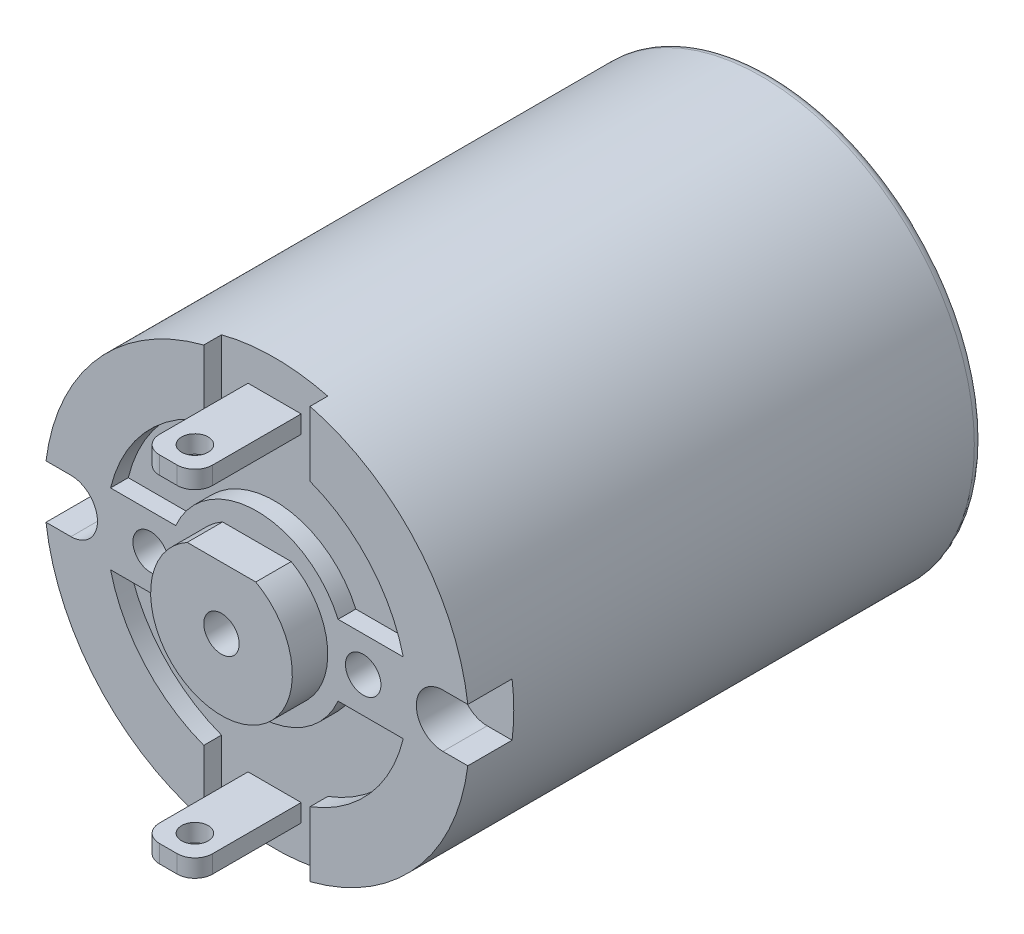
ISO-10303-21;
HEADER;
FILE_DESCRIPTION(('STEP AP214'),'2;1');
FILE_NAME('part.step','',(''),(''),'','','');
FILE_SCHEMA(('AUTOMOTIVE_DESIGN { 1 0 10303 214 1 1 1 1 }'));
ENDSEC;
DATA;
#1=APPLICATION_CONTEXT('core data for automotive mechanical design processes');
#2=APPLICATION_PROTOCOL_DEFINITION('international standard','automotive_design',2000,#1);
#3=PRODUCT_CONTEXT('',#1,'mechanical');
#4=PRODUCT('Part','Part','',(#3));
#5=PRODUCT_RELATED_PRODUCT_CATEGORY('part','',(#4));
#6=PRODUCT_DEFINITION_FORMATION('','',#4);
#7=PRODUCT_DEFINITION_CONTEXT('part definition',#1,'design');
#8=PRODUCT_DEFINITION('design','',#6,#7);
#9=PRODUCT_DEFINITION_SHAPE('','',#8);
#10=(LENGTH_UNIT() NAMED_UNIT(*) SI_UNIT(.MILLI.,.METRE.));
#11=(NAMED_UNIT(*) PLANE_ANGLE_UNIT() SI_UNIT($,.RADIAN.));
#12=(NAMED_UNIT(*) SI_UNIT($,.STERADIAN.) SOLID_ANGLE_UNIT());
#13=UNCERTAINTY_MEASURE_WITH_UNIT(LENGTH_MEASURE(1.E-05),#10,'distance_accuracy_value','');
#14=(GEOMETRIC_REPRESENTATION_CONTEXT(3) GLOBAL_UNCERTAINTY_ASSIGNED_CONTEXT((#13)) GLOBAL_UNIT_ASSIGNED_CONTEXT((#10,
#11,#12)) REPRESENTATION_CONTEXT('',''));
#15=CARTESIAN_POINT('',(0.,0.,0.));
#16=DIRECTION('',(0.,0.,1.));
#17=DIRECTION('',(1.,0.,0.));
#18=AXIS2_PLACEMENT_3D('',#15,#16,#17);
#19=CARTESIAN_POINT('',(0.,0.,29.));
#20=DIRECTION('',(0.,0.,1.));
#21=DIRECTION('',(1.,0.,0.));
#22=AXIS2_PLACEMENT_3D('',#19,#20,#21);
#23=PLANE('',#22);
#24=CARTESIAN_POINT('',(0.,0.,29.));
#25=DIRECTION('',(0.,0.,1.));
#26=DIRECTION('',(1.,0.,0.));
#27=AXIS2_PLACEMENT_3D('',#24,#25,#26);
#28=CIRCLE('',#27,4.);
#29=CARTESIAN_POINT('',(-1.93649167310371,3.5,29.));
#30=VERTEX_POINT('',#29);
#31=CARTESIAN_POINT('',(1.93649167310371,3.5,29.));
#32=VERTEX_POINT('',#31);
#33=EDGE_CURVE('E562',#30,#32,#28,.T.);
#34=ORIENTED_EDGE('',*,*,#33,.F.);
#35=DIRECTION('',(1.,0.,0.));
#36=VECTOR('',#35,1.);
#37=CARTESIAN_POINT('',(-6.,3.5,29.));
#38=LINE('',#37,#36);
#39=EDGE_CURVE('E538',#30,#32,#38,.T.);
#40=ORIENTED_EDGE('',*,*,#39,.T.);
#41=EDGE_LOOP('',(#34,#40));
#42=FACE_BOUND('',#41,.T.);
#43=CARTESIAN_POINT('',(6.,0.,29.));
#44=DIRECTION('',(0.,0.,1.));
#45=DIRECTION('',(1.,0.,0.));
#46=AXIS2_PLACEMENT_3D('',#43,#44,#45);
#47=CIRCLE('',#46,1.);
#48=CARTESIAN_POINT('',(7.,0.,29.));
#49=VERTEX_POINT('',#48);
#50=EDGE_CURVE('E550',#49,#49,#47,.T.);
#51=ORIENTED_EDGE('',*,*,#50,.F.);
#52=EDGE_LOOP('',(#51));
#53=FACE_BOUND('',#52,.T.);
#54=CARTESIAN_POINT('',(-6.,0.,29.));
#55=DIRECTION('',(0.,0.,1.));
#56=DIRECTION('',(1.,0.,0.));
#57=AXIS2_PLACEMENT_3D('',#54,#55,#56);
#58=CIRCLE('',#57,1.);
#59=CARTESIAN_POINT('',(-5.,0.,29.));
#60=VERTEX_POINT('',#59);
#61=EDGE_CURVE('E556',#60,#60,#58,.T.);
#62=ORIENTED_EDGE('',*,*,#61,.F.);
#63=EDGE_LOOP('',(#62));
#64=FACE_BOUND('',#63,.T.);
#65=CARTESIAN_POINT('',(-10.5,0.,29.));
#66=DIRECTION('',(0.,0.,-1.));
#67=DIRECTION('',(-1.,0.,0.));
#68=AXIS2_PLACEMENT_3D('',#65,#66,#67);
#69=CIRCLE('',#68,1.5);
#70=CARTESIAN_POINT('',(-10.5,1.5,29.));
#71=VERTEX_POINT('',#70);
#72=CARTESIAN_POINT('',(-10.5,-1.5,29.));
#73=VERTEX_POINT('',#72);
#74=EDGE_CURVE('E393',#71,#73,#69,.T.);
#75=ORIENTED_EDGE('',*,*,#74,.T.);
#76=DIRECTION('',(-1.,0.,0.));
#77=VECTOR('',#76,1.);
#78=CARTESIAN_POINT('',(-10.5,-1.5,29.));
#79=LINE('',#78,#77);
#80=CARTESIAN_POINT('',(-11.9058808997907,-1.5,29.));
#81=VERTEX_POINT('',#80);
#82=EDGE_CURVE('E403',#73,#81,#79,.T.);
#83=ORIENTED_EDGE('',*,*,#82,.T.);
#84=CARTESIAN_POINT('',(0.,0.,29.));
#85=DIRECTION('',(0.,0.,1.));
#86=DIRECTION('',(1.,0.,0.));
#87=AXIS2_PLACEMENT_3D('',#84,#85,#86);
#88=CIRCLE('',#87,12.);
#89=CARTESIAN_POINT('',(-3.,-11.6189500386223,29.));
#90=VERTEX_POINT('',#89);
#91=EDGE_CURVE('E701',#81,#90,#88,.T.);
#92=ORIENTED_EDGE('',*,*,#91,.T.);
#93=DIRECTION('',(0.,1.,0.));
#94=VECTOR('',#93,1.);
#95=CARTESIAN_POINT('',(-3.,-18.,29.));
#96=LINE('',#95,#94);
#97=CARTESIAN_POINT('',(-3.,-7.95298686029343,29.));
#98=VERTEX_POINT('',#97);
#99=EDGE_CURVE('E462',#90,#98,#96,.T.);
#100=ORIENTED_EDGE('',*,*,#99,.T.);
#101=CARTESIAN_POINT('',(0.,0.,29.));
#102=DIRECTION('',(0.,0.,1.));
#103=DIRECTION('',(1.,0.,0.));
#104=AXIS2_PLACEMENT_3D('',#101,#102,#103);
#105=CIRCLE('',#104,8.5);
#106=CARTESIAN_POINT('',(-8.26135582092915,-2.,29.));
#107=VERTEX_POINT('',#106);
#108=EDGE_CURVE('E609',#107,#98,#105,.T.);
#109=ORIENTED_EDGE('',*,*,#108,.F.);
#110=DIRECTION('',(-1.,0.,0.));
#111=VECTOR('',#110,1.);
#112=CARTESIAN_POINT('',(-8.26135582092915,-2.,29.));
#113=LINE('',#112,#111);
#114=CARTESIAN_POINT('',(-4.58257569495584,-2.,29.));
#115=VERTEX_POINT('',#114);
#116=EDGE_CURVE('E605',#115,#107,#113,.T.);
#117=ORIENTED_EDGE('',*,*,#116,.F.);
#118=CARTESIAN_POINT('',(0.,0.,29.));
#119=DIRECTION('',(0.,0.,-1.));
#120=DIRECTION('',(1.,0.,0.));
#121=AXIS2_PLACEMENT_3D('',#118,#119,#120);
#122=CIRCLE('',#121,5.);
#123=CARTESIAN_POINT('',(4.58257569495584,-2.,29.));
#124=VERTEX_POINT('',#123);
#125=EDGE_CURVE('E596',#124,#115,#122,.T.);
#126=ORIENTED_EDGE('',*,*,#125,.F.);
#127=DIRECTION('',(-1.,0.,0.));
#128=VECTOR('',#127,1.);
#129=CARTESIAN_POINT('',(4.58257569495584,-2.,29.));
#130=LINE('',#129,#128);
#131=CARTESIAN_POINT('',(8.26135582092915,-2.,29.));
#132=VERTEX_POINT('',#131);
#133=EDGE_CURVE('E612',#132,#124,#130,.T.);
#134=ORIENTED_EDGE('',*,*,#133,.F.);
#135=CARTESIAN_POINT('',(3.,-7.95298686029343,29.));
#136=VERTEX_POINT('',#135);
#137=EDGE_CURVE('E608',#136,#132,#105,.T.);
#138=ORIENTED_EDGE('',*,*,#137,.F.);
#139=DIRECTION('',(0.,-1.,0.));
#140=VECTOR('',#139,1.);
#141=CARTESIAN_POINT('',(3.,-18.,29.));
#142=LINE('',#141,#140);
#143=CARTESIAN_POINT('',(3.,-11.6189500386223,29.));
#144=VERTEX_POINT('',#143);
#145=EDGE_CURVE('E466',#136,#144,#142,.T.);
#146=ORIENTED_EDGE('',*,*,#145,.T.);
#147=CARTESIAN_POINT('',(11.9058808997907,-1.5,29.));
#148=VERTEX_POINT('',#147);
#149=EDGE_CURVE('E702',#144,#148,#88,.T.);
#150=ORIENTED_EDGE('',*,*,#149,.T.);
#151=DIRECTION('',(1.,0.,0.));
#152=VECTOR('',#151,1.);
#153=CARTESIAN_POINT('',(10.5,-1.5,29.));
#154=LINE('',#153,#152);
#155=CARTESIAN_POINT('',(10.5,-1.5,29.));
#156=VERTEX_POINT('',#155);
#157=EDGE_CURVE('E416',#156,#148,#154,.T.);
#158=ORIENTED_EDGE('',*,*,#157,.F.);
#159=CARTESIAN_POINT('',(10.5,0.,29.));
#160=DIRECTION('',(0.,0.,1.));
#161=DIRECTION('',(1.,0.,0.));
#162=AXIS2_PLACEMENT_3D('',#159,#160,#161);
#163=CIRCLE('',#162,1.5);
#164=CARTESIAN_POINT('',(10.5,1.5,29.));
#165=VERTEX_POINT('',#164);
#166=EDGE_CURVE('E412',#165,#156,#163,.T.);
#167=ORIENTED_EDGE('',*,*,#166,.F.);
#168=DIRECTION('',(-1.,0.,0.));
#169=VECTOR('',#168,1.);
#170=CARTESIAN_POINT('',(10.5,1.5,29.));
#171=LINE('',#170,#169);
#172=CARTESIAN_POINT('',(11.9058808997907,1.5,29.));
#173=VERTEX_POINT('',#172);
#174=EDGE_CURVE('E418',#173,#165,#171,.T.);
#175=ORIENTED_EDGE('',*,*,#174,.F.);
#176=CARTESIAN_POINT('',(3.,11.6189500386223,29.));
#177=VERTEX_POINT('',#176);
#178=EDGE_CURVE('E698',#173,#177,#88,.T.);
#179=ORIENTED_EDGE('',*,*,#178,.T.);
#180=DIRECTION('',(0.,1.,0.));
#181=VECTOR('',#180,1.);
#182=CARTESIAN_POINT('',(3.,18.,29.));
#183=LINE('',#182,#181);
#184=CARTESIAN_POINT('',(3.,7.95298686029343,29.));
#185=VERTEX_POINT('',#184);
#186=EDGE_CURVE('E518',#185,#177,#183,.T.);
#187=ORIENTED_EDGE('',*,*,#186,.F.);
#188=CARTESIAN_POINT('',(0.,0.,29.));
#189=DIRECTION('',(0.,0.,1.));
#190=DIRECTION('',(1.,0.,0.));
#191=AXIS2_PLACEMENT_3D('',#188,#189,#190);
#192=CIRCLE('',#191,8.5);
#193=CARTESIAN_POINT('',(8.26135582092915,2.,29.));
#194=VERTEX_POINT('',#193);
#195=EDGE_CURVE('E574',#194,#185,#192,.T.);
#196=ORIENTED_EDGE('',*,*,#195,.F.);
#197=DIRECTION('',(1.,0.,0.));
#198=VECTOR('',#197,1.);
#199=CARTESIAN_POINT('',(4.58257569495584,2.,29.));
#200=LINE('',#199,#198);
#201=CARTESIAN_POINT('',(4.58257569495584,2.,29.));
#202=VERTEX_POINT('',#201);
#203=EDGE_CURVE('E570',#202,#194,#200,.T.);
#204=ORIENTED_EDGE('',*,*,#203,.F.);
#205=CARTESIAN_POINT('',(0.,0.,29.));
#206=DIRECTION('',(0.,0.,-1.));
#207=DIRECTION('',(1.,0.,0.));
#208=AXIS2_PLACEMENT_3D('',#205,#206,#207);
#209=CIRCLE('',#208,5.);
#210=CARTESIAN_POINT('',(-4.58257569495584,2.,29.));
#211=VERTEX_POINT('',#210);
#212=EDGE_CURVE('E568',#211,#202,#209,.T.);
#213=ORIENTED_EDGE('',*,*,#212,.F.);
#214=DIRECTION('',(1.,0.,0.));
#215=VECTOR('',#214,1.);
#216=CARTESIAN_POINT('',(-8.26135582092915,2.,29.));
#217=LINE('',#216,#215);
#218=CARTESIAN_POINT('',(-8.26135582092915,2.,29.));
#219=VERTEX_POINT('',#218);
#220=EDGE_CURVE('E577',#219,#211,#217,.T.);
#221=ORIENTED_EDGE('',*,*,#220,.F.);
#222=CARTESIAN_POINT('',(-3.,7.95298686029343,29.));
#223=VERTEX_POINT('',#222);
#224=EDGE_CURVE('E573',#223,#219,#192,.T.);
#225=ORIENTED_EDGE('',*,*,#224,.F.);
#226=DIRECTION('',(0.,-1.,0.));
#227=VECTOR('',#226,1.);
#228=CARTESIAN_POINT('',(-3.,18.,29.));
#229=LINE('',#228,#227);
#230=CARTESIAN_POINT('',(-3.,11.6189500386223,29.));
#231=VERTEX_POINT('',#230);
#232=EDGE_CURVE('E514',#231,#223,#229,.T.);
#233=ORIENTED_EDGE('',*,*,#232,.F.);
#234=CARTESIAN_POINT('',(-11.9058808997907,1.5,29.));
#235=VERTEX_POINT('',#234);
#236=EDGE_CURVE('E402',#231,#235,#88,.T.);
#237=ORIENTED_EDGE('',*,*,#236,.T.);
#238=DIRECTION('',(1.,0.,0.));
#239=VECTOR('',#238,1.);
#240=CARTESIAN_POINT('',(-10.5,1.5,29.));
#241=LINE('',#240,#239);
#242=EDGE_CURVE('E384',#235,#71,#241,.T.);
#243=ORIENTED_EDGE('',*,*,#242,.T.);
#244=EDGE_LOOP('',(#75,#83,#92,#100,#109,#117,#126,#134,#138,#146,#150,#158,#167,#175,#179,#187,
#196,#204,#213,#221,#225,#233,#237,#243));
#245=FACE_BOUND('',#244,.T.);
#246=ADVANCED_FACE('F40',(#42,#53,#64,#245),#23,.T.);
#247=CARTESIAN_POINT('',(0.,0.,29.));
#248=DIRECTION('',(0.,0.,-1.));
#249=DIRECTION('',(-1.,0.,0.));
#250=AXIS2_PLACEMENT_3D('',#247,#248,#249);
#251=CYLINDRICAL_SURFACE('',#250,12.);
#252=CARTESIAN_POINT('',(0.,0.,0.5));
#253=DIRECTION('',(0.,0.,1.));
#254=DIRECTION('',(1.,0.,0.));
#255=AXIS2_PLACEMENT_3D('',#252,#253,#254);
#256=CIRCLE('',#255,12.);
#257=CARTESIAN_POINT('',(12.,0.,0.5));
#258=VERTEX_POINT('',#257);
#259=EDGE_CURVE('E705',#258,#258,#256,.T.);
#260=ORIENTED_EDGE('',*,*,#259,.T.);
#261=EDGE_LOOP('',(#260));
#262=FACE_BOUND('',#261,.T.);
#263=DIRECTION('',(0.,0.,-1.));
#264=VECTOR('',#263,1.);
#265=CARTESIAN_POINT('',(-11.9058808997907,-1.5,29.));
#266=LINE('',#265,#264);
#267=CARTESIAN_POINT('',(-11.9058808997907,-1.5,26.5));
#268=VERTEX_POINT('',#267);
#269=EDGE_CURVE('E11',#268,#81,#266,.F.);
#270=ORIENTED_EDGE('',*,*,#269,.F.);
#271=CARTESIAN_POINT('',(0.,0.,26.5));
#272=DIRECTION('',(0.,0.,1.));
#273=DIRECTION('',(1.,0.,0.));
#274=AXIS2_PLACEMENT_3D('',#271,#272,#273);
#275=CIRCLE('',#274,12.);
#276=CARTESIAN_POINT('',(-11.9058808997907,1.5,26.5));
#277=VERTEX_POINT('',#276);
#278=EDGE_CURVE('E841',#277,#268,#275,.T.);
#279=ORIENTED_EDGE('',*,*,#278,.F.);
#280=DIRECTION('',(0.,0.,-1.));
#281=VECTOR('',#280,1.);
#282=CARTESIAN_POINT('',(-11.9058808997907,1.5,29.));
#283=LINE('',#282,#281);
#284=EDGE_CURVE('E48',#235,#277,#283,.T.);
#285=ORIENTED_EDGE('',*,*,#284,.F.);
#286=ORIENTED_EDGE('',*,*,#236,.F.);
#287=DIRECTION('',(0.,0.,-1.));
#288=VECTOR('',#287,1.);
#289=CARTESIAN_POINT('',(-3.,11.6189500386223,29.));
#290=LINE('',#289,#288);
#291=CARTESIAN_POINT('',(-3.,11.6189500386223,28.));
#292=VERTEX_POINT('',#291);
#293=EDGE_CURVE('E533',#231,#292,#290,.T.);
#294=ORIENTED_EDGE('',*,*,#293,.T.);
#295=CARTESIAN_POINT('',(0.,0.,28.));
#296=DIRECTION('',(0.,0.,1.));
#297=DIRECTION('',(1.,0.,0.));
#298=AXIS2_PLACEMENT_3D('',#295,#296,#297);
#299=CIRCLE('',#298,12.);
#300=CARTESIAN_POINT('',(3.,11.6189500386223,28.));
#301=VERTEX_POINT('',#300);
#302=EDGE_CURVE('E536',#301,#292,#299,.T.);
#303=ORIENTED_EDGE('',*,*,#302,.F.);
#304=DIRECTION('',(0.,0.,-1.));
#305=VECTOR('',#304,1.);
#306=CARTESIAN_POINT('',(3.,11.6189500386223,29.));
#307=LINE('',#306,#305);
#308=EDGE_CURVE('E527',#301,#177,#307,.F.);
#309=ORIENTED_EDGE('',*,*,#308,.T.);
#310=ORIENTED_EDGE('',*,*,#178,.F.);
#311=DIRECTION('',(0.,0.,-1.));
#312=VECTOR('',#311,1.);
#313=CARTESIAN_POINT('',(11.9058808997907,1.5,29.));
#314=LINE('',#313,#312);
#315=CARTESIAN_POINT('',(11.9058808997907,1.5,26.5));
#316=VERTEX_POINT('',#315);
#317=EDGE_CURVE('E838',#173,#316,#314,.T.);
#318=ORIENTED_EDGE('',*,*,#317,.T.);
#319=CARTESIAN_POINT('',(0.,0.,26.5));
#320=DIRECTION('',(0.,0.,1.));
#321=DIRECTION('',(1.,0.,0.));
#322=AXIS2_PLACEMENT_3D('',#319,#320,#321);
#323=CIRCLE('',#322,12.);
#324=CARTESIAN_POINT('',(11.9058808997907,-1.5,26.5));
#325=VERTEX_POINT('',#324);
#326=EDGE_CURVE('E833',#325,#316,#323,.T.);
#327=ORIENTED_EDGE('',*,*,#326,.F.);
#328=DIRECTION('',(0.,0.,-1.));
#329=VECTOR('',#328,1.);
#330=CARTESIAN_POINT('',(11.9058808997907,-1.5,29.));
#331=LINE('',#330,#329);
#332=EDGE_CURVE('E835',#325,#148,#331,.F.);
#333=ORIENTED_EDGE('',*,*,#332,.T.);
#334=ORIENTED_EDGE('',*,*,#149,.F.);
#335=DIRECTION('',(0.,0.,-1.));
#336=VECTOR('',#335,1.);
#337=CARTESIAN_POINT('',(3.,-11.6189500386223,29.));
#338=LINE('',#337,#336);
#339=CARTESIAN_POINT('',(3.,-11.6189500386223,28.));
#340=VERTEX_POINT('',#339);
#341=EDGE_CURVE('E480',#340,#144,#338,.F.);
#342=ORIENTED_EDGE('',*,*,#341,.F.);
#343=CARTESIAN_POINT('',(0.,0.,28.));
#344=DIRECTION('',(0.,0.,1.));
#345=DIRECTION('',(1.,0.,0.));
#346=AXIS2_PLACEMENT_3D('',#343,#344,#345);
#347=CIRCLE('',#346,12.);
#348=CARTESIAN_POINT('',(-3.,-11.6189500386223,28.));
#349=VERTEX_POINT('',#348);
#350=EDGE_CURVE('E482',#349,#340,#347,.T.);
#351=ORIENTED_EDGE('',*,*,#350,.F.);
#352=DIRECTION('',(0.,0.,-1.));
#353=VECTOR('',#352,1.);
#354=CARTESIAN_POINT('',(-3.,-11.6189500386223,29.));
#355=LINE('',#354,#353);
#356=EDGE_CURVE('E475',#90,#349,#355,.T.);
#357=ORIENTED_EDGE('',*,*,#356,.F.);
#358=ORIENTED_EDGE('',*,*,#91,.F.);
#359=EDGE_LOOP('',(#270,#279,#285,#286,#294,#303,#309,#310,#318,#327,#333,#334,#342,#351,#357,#358));
#360=FACE_BOUND('',#359,.T.);
#361=ADVANCED_FACE('F42',(#262,#360),#251,.T.);
#362=CARTESIAN_POINT('',(-1.5,-10.,34.));
#363=DIRECTION('',(0.,-1.,0.));
#364=DIRECTION('',(0.,0.,-1.));
#365=AXIS2_PLACEMENT_3D('',#362,#363,#364);
#366=PLANE('',#365);
#367=DIRECTION('',(0.,0.,-1.));
#368=VECTOR('',#367,1.);
#369=CARTESIAN_POINT('',(1.5,-10.,34.));
#370=LINE('',#369,#368);
#371=CARTESIAN_POINT('',(1.5,-10.,33.));
#372=VERTEX_POINT('',#371);
#373=CARTESIAN_POINT('',(1.5,-10.,28.));
#374=VERTEX_POINT('',#373);
#375=EDGE_CURVE('E458',#372,#374,#370,.T.);
#376=ORIENTED_EDGE('',*,*,#375,.F.);
#377=CARTESIAN_POINT('',(0.499999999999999,-10.,33.));
#378=DIRECTION('',(0.,-1.,0.));
#379=DIRECTION('',(0.,0.,-1.));
#380=AXIS2_PLACEMENT_3D('',#377,#378,#379);
#381=CIRCLE('',#380,1.);
#382=CARTESIAN_POINT('',(0.499999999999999,-10.,34.));
#383=VERTEX_POINT('',#382);
#384=EDGE_CURVE('E820',#372,#383,#381,.T.);
#385=ORIENTED_EDGE('',*,*,#384,.T.);
#386=DIRECTION('',(-1.,0.,0.));
#387=VECTOR('',#386,1.);
#388=CARTESIAN_POINT('',(-1.5,-10.,34.));
#389=LINE('',#388,#387);
#390=CARTESIAN_POINT('',(-0.500000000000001,-10.,34.));
#391=VERTEX_POINT('',#390);
#392=EDGE_CURVE('E448',#383,#391,#389,.T.);
#393=ORIENTED_EDGE('',*,*,#392,.T.);
#394=CARTESIAN_POINT('',(-0.500000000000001,-10.,33.));
#395=DIRECTION('',(0.,-1.,0.));
#396=DIRECTION('',(0.,0.,-1.));
#397=AXIS2_PLACEMENT_3D('',#394,#395,#396);
#398=CIRCLE('',#397,1.);
#399=CARTESIAN_POINT('',(-1.5,-10.,33.));
#400=VERTEX_POINT('',#399);
#401=EDGE_CURVE('E818',#391,#400,#398,.T.);
#402=ORIENTED_EDGE('',*,*,#401,.T.);
#403=DIRECTION('',(0.,0.,-1.));
#404=VECTOR('',#403,1.);
#405=CARTESIAN_POINT('',(-1.5,-10.,34.));
#406=LINE('',#405,#404);
#407=CARTESIAN_POINT('',(-1.5,-10.,28.));
#408=VERTEX_POINT('',#407);
#409=EDGE_CURVE('E460',#400,#408,#406,.T.);
#410=ORIENTED_EDGE('',*,*,#409,.T.);
#411=DIRECTION('',(-1.,0.,0.));
#412=VECTOR('',#411,1.);
#413=CARTESIAN_POINT('',(-1.5,-10.,28.));
#414=LINE('',#413,#412);
#415=EDGE_CURVE('E439',#374,#408,#414,.T.);
#416=ORIENTED_EDGE('',*,*,#415,.F.);
#417=EDGE_LOOP('',(#376,#385,#393,#402,#410,#416));
#418=FACE_BOUND('',#417,.T.);
#419=CARTESIAN_POINT('',(0.,-10.,32.5));
#420=DIRECTION('',(0.,-1.,0.));
#421=DIRECTION('',(0.,0.,-1.));
#422=AXIS2_PLACEMENT_3D('',#419,#420,#421);
#423=CIRCLE('',#422,0.75);
#424=CARTESIAN_POINT('',(0.,-10.,31.75));
#425=VERTEX_POINT('',#424);
#426=EDGE_CURVE('E433',#425,#425,#423,.F.);
#427=ORIENTED_EDGE('',*,*,#426,.T.);
#428=EDGE_LOOP('',(#427));
#429=FACE_BOUND('',#428,.T.);
#430=ADVANCED_FACE('F904',(#418,#429),#366,.T.);
#431=CARTESIAN_POINT('',(-1.5,-9.,34.));
#432=DIRECTION('',(0.,1.,0.));
#433=DIRECTION('',(0.,0.,1.));
#434=AXIS2_PLACEMENT_3D('',#431,#432,#433);
#435=PLANE('',#434);
#436=DIRECTION('',(1.,0.,0.));
#437=VECTOR('',#436,1.);
#438=CARTESIAN_POINT('',(-1.5,-9.,34.));
#439=LINE('',#438,#437);
#440=CARTESIAN_POINT('',(-0.500000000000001,-9.,34.));
#441=VERTEX_POINT('',#440);
#442=CARTESIAN_POINT('',(0.499999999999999,-9.,34.));
#443=VERTEX_POINT('',#442);
#444=EDGE_CURVE('E451',#441,#443,#439,.T.);
#445=ORIENTED_EDGE('',*,*,#444,.T.);
#446=CARTESIAN_POINT('',(0.499999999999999,-9.,33.));
#447=DIRECTION('',(0.,1.,0.));
#448=DIRECTION('',(0.,0.,1.));
#449=AXIS2_PLACEMENT_3D('',#446,#447,#448);
#450=CIRCLE('',#449,1.);
#451=CARTESIAN_POINT('',(1.5,-9.,33.));
#452=VERTEX_POINT('',#451);
#453=EDGE_CURVE('E828',#443,#452,#450,.T.);
#454=ORIENTED_EDGE('',*,*,#453,.T.);
#455=DIRECTION('',(0.,0.,-1.));
#456=VECTOR('',#455,1.);
#457=CARTESIAN_POINT('',(1.5,-9.,34.));
#458=LINE('',#457,#456);
#459=CARTESIAN_POINT('',(1.5,-9.,28.));
#460=VERTEX_POINT('',#459);
#461=EDGE_CURVE('E456',#452,#460,#458,.T.);
#462=ORIENTED_EDGE('',*,*,#461,.T.);
#463=DIRECTION('',(1.,0.,0.));
#464=VECTOR('',#463,1.);
#465=CARTESIAN_POINT('',(-1.5,-9.,28.));
#466=LINE('',#465,#464);
#467=CARTESIAN_POINT('',(-1.5,-9.,28.));
#468=VERTEX_POINT('',#467);
#469=EDGE_CURVE('E445',#468,#460,#466,.T.);
#470=ORIENTED_EDGE('',*,*,#469,.F.);
#471=DIRECTION('',(0.,0.,-1.));
#472=VECTOR('',#471,1.);
#473=CARTESIAN_POINT('',(-1.5,-9.,34.));
#474=LINE('',#473,#472);
#475=CARTESIAN_POINT('',(-1.5,-9.,33.));
#476=VERTEX_POINT('',#475);
#477=EDGE_CURVE('E454',#476,#468,#474,.T.);
#478=ORIENTED_EDGE('',*,*,#477,.F.);
#479=CARTESIAN_POINT('',(-0.500000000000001,-9.,33.));
#480=DIRECTION('',(0.,1.,0.));
#481=DIRECTION('',(0.,0.,1.));
#482=AXIS2_PLACEMENT_3D('',#479,#480,#481);
#483=CIRCLE('',#482,1.);
#484=EDGE_CURVE('E826',#476,#441,#483,.T.);
#485=ORIENTED_EDGE('',*,*,#484,.T.);
#486=EDGE_LOOP('',(#445,#454,#462,#470,#478,#485));
#487=FACE_BOUND('',#486,.T.);
#488=CARTESIAN_POINT('',(0.,-9.,32.5));
#489=DIRECTION('',(0.,-1.,0.));
#490=DIRECTION('',(0.,0.,-1.));
#491=AXIS2_PLACEMENT_3D('',#488,#489,#490);
#492=CIRCLE('',#491,0.75);
#493=CARTESIAN_POINT('',(0.,-9.,31.75));
#494=VERTEX_POINT('',#493);
#495=EDGE_CURVE('E429',#494,#494,#492,.T.);
#496=ORIENTED_EDGE('',*,*,#495,.T.);
#497=EDGE_LOOP('',(#496));
#498=FACE_BOUND('',#497,.T.);
#499=ADVANCED_FACE('F1030',(#487,#498),#435,.T.);
#500=CARTESIAN_POINT('',(0.,0.,28.));
#501=DIRECTION('',(0.,0.,1.));
#502=DIRECTION('',(1.,0.,0.));
#503=AXIS2_PLACEMENT_3D('',#500,#501,#502);
#504=CYLINDRICAL_SURFACE('',#503,8.5);
#505=DIRECTION('',(0.,0.,1.));
#506=VECTOR('',#505,1.);
#507=CARTESIAN_POINT('',(3.,-7.95298686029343,28.));
#508=LINE('',#507,#506);
#509=CARTESIAN_POINT('',(3.,-7.95298686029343,28.));
#510=VERTEX_POINT('',#509);
#511=EDGE_CURVE('E477',#136,#510,#508,.F.);
#512=ORIENTED_EDGE('',*,*,#511,.F.);
#513=ORIENTED_EDGE('',*,*,#137,.T.);
#514=DIRECTION('',(0.,0.,1.));
#515=VECTOR('',#514,1.);
#516=CARTESIAN_POINT('',(8.26135582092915,-2.,28.));
#517=LINE('',#516,#515);
#518=CARTESIAN_POINT('',(8.26135582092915,-2.,28.));
#519=VERTEX_POINT('',#518);
#520=EDGE_CURVE('E632',#519,#132,#517,.T.);
#521=ORIENTED_EDGE('',*,*,#520,.F.);
#522=CARTESIAN_POINT('',(0.,0.,28.));
#523=DIRECTION('',(0.,0.,1.));
#524=DIRECTION('',(1.,0.,0.));
#525=AXIS2_PLACEMENT_3D('',#522,#523,#524);
#526=CIRCLE('',#525,8.5);
#527=EDGE_CURVE('E621',#510,#519,#526,.T.);
#528=ORIENTED_EDGE('',*,*,#527,.F.);
#529=EDGE_LOOP('',(#512,#513,#521,#528));
#530=FACE_BOUND('',#529,.T.);
#531=ADVANCED_FACE('F1026',(#530),#504,.F.);
#532=DIRECTION('',(0.,0.,1.));
#533=VECTOR('',#532,1.);
#534=CARTESIAN_POINT('',(-3.,-7.95298686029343,28.));
#535=LINE('',#534,#533);
#536=CARTESIAN_POINT('',(-3.,-7.95298686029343,28.));
#537=VERTEX_POINT('',#536);
#538=EDGE_CURVE('E469',#537,#98,#535,.T.);
#539=ORIENTED_EDGE('',*,*,#538,.F.);
#540=CARTESIAN_POINT('',(-8.26135582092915,-2.,28.));
#541=VERTEX_POINT('',#540);
#542=EDGE_CURVE('E622',#541,#537,#526,.T.);
#543=ORIENTED_EDGE('',*,*,#542,.F.);
#544=DIRECTION('',(0.,0.,1.));
#545=VECTOR('',#544,1.);
#546=CARTESIAN_POINT('',(-8.26135582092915,-2.,28.));
#547=LINE('',#546,#545);
#548=EDGE_CURVE('E635',#541,#107,#547,.T.);
#549=ORIENTED_EDGE('',*,*,#548,.T.);
#550=ORIENTED_EDGE('',*,*,#108,.T.);
#551=EDGE_LOOP('',(#539,#543,#549,#550));
#552=FACE_BOUND('',#551,.T.);
#553=ADVANCED_FACE('F1029',(#552),#504,.F.);
#554=CARTESIAN_POINT('',(0.,0.,28.));
#555=DIRECTION('',(0.,0.,1.));
#556=DIRECTION('',(1.,0.,0.));
#557=AXIS2_PLACEMENT_3D('',#554,#555,#556);
#558=PLANE('',#557);
#559=CARTESIAN_POINT('',(0.,0.,28.));
#560=DIRECTION('',(0.,0.,1.));
#561=DIRECTION('',(1.,0.,0.));
#562=AXIS2_PLACEMENT_3D('',#559,#560,#561);
#563=CIRCLE('',#562,8.5);
#564=CARTESIAN_POINT('',(8.26135582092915,2.,28.));
#565=VERTEX_POINT('',#564);
#566=CARTESIAN_POINT('',(3.,7.95298686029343,28.));
#567=VERTEX_POINT('',#566);
#568=EDGE_CURVE('E587',#565,#567,#563,.T.);
#569=ORIENTED_EDGE('',*,*,#568,.T.);
#570=DIRECTION('',(0.,-1.,0.));
#571=VECTOR('',#570,1.);
#572=CARTESIAN_POINT('',(3.,18.,28.));
#573=LINE('',#572,#571);
#574=EDGE_CURVE('E515',#301,#567,#573,.T.);
#575=ORIENTED_EDGE('',*,*,#574,.F.);
#576=ORIENTED_EDGE('',*,*,#302,.T.);
#577=DIRECTION('',(0.,1.,0.));
#578=VECTOR('',#577,1.);
#579=CARTESIAN_POINT('',(-3.,18.,28.));
#580=LINE('',#579,#578);
#581=CARTESIAN_POINT('',(-3.,7.95298686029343,28.));
#582=VERTEX_POINT('',#581);
#583=EDGE_CURVE('E517',#582,#292,#580,.T.);
#584=ORIENTED_EDGE('',*,*,#583,.F.);
#585=CARTESIAN_POINT('',(-8.26135582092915,2.,28.));
#586=VERTEX_POINT('',#585);
#587=EDGE_CURVE('E586',#582,#586,#563,.T.);
#588=ORIENTED_EDGE('',*,*,#587,.T.);
#589=DIRECTION('',(1.,0.,0.));
#590=VECTOR('',#589,1.);
#591=CARTESIAN_POINT('',(-8.26135582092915,2.,28.));
#592=LINE('',#591,#590);
#593=CARTESIAN_POINT('',(-4.58257569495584,2.,28.));
#594=VERTEX_POINT('',#593);
#595=EDGE_CURVE('E590',#586,#594,#592,.T.);
#596=ORIENTED_EDGE('',*,*,#595,.T.);
#597=CARTESIAN_POINT('',(0.,0.,28.));
#598=DIRECTION('',(0.,0.,-1.));
#599=DIRECTION('',(1.,0.,0.));
#600=AXIS2_PLACEMENT_3D('',#597,#598,#599);
#601=CIRCLE('',#600,5.);
#602=CARTESIAN_POINT('',(4.58257569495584,2.,28.));
#603=VERTEX_POINT('',#602);
#604=EDGE_CURVE('E580',#594,#603,#601,.T.);
#605=ORIENTED_EDGE('',*,*,#604,.T.);
#606=DIRECTION('',(1.,0.,0.));
#607=VECTOR('',#606,1.);
#608=CARTESIAN_POINT('',(4.58257569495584,2.,28.));
#609=LINE('',#608,#607);
#610=EDGE_CURVE('E583',#603,#565,#609,.T.);
#611=ORIENTED_EDGE('',*,*,#610,.T.);
#612=EDGE_LOOP('',(#569,#575,#576,#584,#588,#596,#605,#611));
#613=FACE_BOUND('',#612,.T.);
#614=DIRECTION('',(1.,0.,0.));
#615=VECTOR('',#614,1.);
#616=CARTESIAN_POINT('',(-1.5,9.,28.));
#617=LINE('',#616,#615);
#618=CARTESIAN_POINT('',(-1.5,9.,28.));
#619=VERTEX_POINT('',#618);
#620=CARTESIAN_POINT('',(1.5,9.,28.));
#621=VERTEX_POINT('',#620);
#622=EDGE_CURVE('E491',#619,#621,#617,.T.);
#623=ORIENTED_EDGE('',*,*,#622,.F.);
#624=DIRECTION('',(0.,-1.,0.));
#625=VECTOR('',#624,1.);
#626=CARTESIAN_POINT('',(-1.5,10.,28.));
#627=LINE('',#626,#625);
#628=CARTESIAN_POINT('',(-1.5,10.,28.));
#629=VERTEX_POINT('',#628);
#630=EDGE_CURVE('E488',#629,#619,#627,.T.);
#631=ORIENTED_EDGE('',*,*,#630,.F.);
#632=DIRECTION('',(-1.,0.,0.));
#633=VECTOR('',#632,1.);
#634=CARTESIAN_POINT('',(-1.5,10.,28.));
#635=LINE('',#634,#633);
#636=CARTESIAN_POINT('',(1.5,10.,28.));
#637=VERTEX_POINT('',#636);
#638=EDGE_CURVE('E497',#637,#629,#635,.T.);
#639=ORIENTED_EDGE('',*,*,#638,.F.);
#640=DIRECTION('',(0.,1.,0.));
#641=VECTOR('',#640,1.);
#642=CARTESIAN_POINT('',(1.5,10.,28.));
#643=LINE('',#642,#641);
#644=EDGE_CURVE('E494',#621,#637,#643,.T.);
#645=ORIENTED_EDGE('',*,*,#644,.F.);
#646=EDGE_LOOP('',(#623,#631,#639,#645));
#647=FACE_BOUND('',#646,.T.);
#648=ADVANCED_FACE('F863',(#613,#647),#558,.T.);
#649=CARTESIAN_POINT('',(0.,0.,28.));
#650=DIRECTION('',(0.,0.,1.));
#651=DIRECTION('',(1.,0.,0.));
#652=AXIS2_PLACEMENT_3D('',#649,#650,#651);
#653=CYLINDRICAL_SURFACE('',#652,8.5);
#654=ORIENTED_EDGE('',*,*,#587,.F.);
#655=DIRECTION('',(0.,0.,1.));
#656=VECTOR('',#655,1.);
#657=CARTESIAN_POINT('',(-3.,7.95298686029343,28.));
#658=LINE('',#657,#656);
#659=EDGE_CURVE('E530',#582,#223,#658,.T.);
#660=ORIENTED_EDGE('',*,*,#659,.T.);
#661=ORIENTED_EDGE('',*,*,#224,.T.);
#662=DIRECTION('',(0.,0.,1.));
#663=VECTOR('',#662,1.);
#664=CARTESIAN_POINT('',(-8.26135582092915,2.,28.));
#665=LINE('',#664,#663);
#666=EDGE_CURVE('E597',#586,#219,#665,.T.);
#667=ORIENTED_EDGE('',*,*,#666,.F.);
#668=EDGE_LOOP('',(#654,#660,#661,#667));
#669=FACE_BOUND('',#668,.T.);
#670=ADVANCED_FACE('F872',(#669),#653,.F.);
#671=CARTESIAN_POINT('',(0.,0.,0.));
#672=DIRECTION('',(0.,0.,1.));
#673=DIRECTION('',(1.,0.,0.));
#674=AXIS2_PLACEMENT_3D('',#671,#672,#673);
#675=PLANE('',#674);
#676=DIRECTION('',(-1.,0.,0.));
#677=VECTOR('',#676,1.);
#678=CARTESIAN_POINT('',(2.,-10.,0.));
#679=LINE('',#678,#677);
#680=CARTESIAN_POINT('',(2.3,-10.,0.));
#681=VERTEX_POINT('',#680);
#682=CARTESIAN_POINT('',(-2.3,-10.,0.));
#683=VERTEX_POINT('',#682);
#684=EDGE_CURVE('E631',#681,#683,#679,.T.);
#685=ORIENTED_EDGE('',*,*,#684,.F.);
#686=DIRECTION('',(0.,-1.,0.));
#687=VECTOR('',#686,1.);
#688=CARTESIAN_POINT('',(2.3,0.,0.));
#689=LINE('',#688,#687);
#690=CARTESIAN_POINT('',(2.3,-9.,0.));
#691=VERTEX_POINT('',#690);
#692=EDGE_CURVE('E770',#681,#691,#689,.F.);
#693=ORIENTED_EDGE('',*,*,#692,.T.);
#694=DIRECTION('',(1.,0.,0.));
#695=VECTOR('',#694,1.);
#696=CARTESIAN_POINT('',(2.,-9.,0.));
#697=LINE('',#696,#695);
#698=CARTESIAN_POINT('',(-2.3,-9.,0.));
#699=VERTEX_POINT('',#698);
#700=EDGE_CURVE('E640',#699,#691,#697,.T.);
#701=ORIENTED_EDGE('',*,*,#700,.F.);
#702=DIRECTION('',(0.,1.,0.));
#703=VECTOR('',#702,1.);
#704=CARTESIAN_POINT('',(-2.3,0.,0.));
#705=LINE('',#704,#703);
#706=EDGE_CURVE('E761',#699,#683,#705,.F.);
#707=ORIENTED_EDGE('',*,*,#706,.T.);
#708=EDGE_LOOP('',(#685,#693,#701,#707));
#709=FACE_BOUND('',#708,.T.);
#710=DIRECTION('',(1.,0.,0.));
#711=VECTOR('',#710,1.);
#712=CARTESIAN_POINT('',(2.,10.,0.));
#713=LINE('',#712,#711);
#714=CARTESIAN_POINT('',(-2.3,10.,0.));
#715=VERTEX_POINT('',#714);
#716=CARTESIAN_POINT('',(2.3,10.,0.));
#717=VERTEX_POINT('',#716);
#718=EDGE_CURVE('E662',#715,#717,#713,.T.);
#719=ORIENTED_EDGE('',*,*,#718,.F.);
#720=DIRECTION('',(0.,1.,0.));
#721=VECTOR('',#720,1.);
#722=CARTESIAN_POINT('',(-2.3,0.,0.));
#723=LINE('',#722,#721);
#724=CARTESIAN_POINT('',(-2.3,9.,0.));
#725=VERTEX_POINT('',#724);
#726=EDGE_CURVE('E767',#715,#725,#723,.F.);
#727=ORIENTED_EDGE('',*,*,#726,.T.);
#728=DIRECTION('',(-1.,0.,0.));
#729=VECTOR('',#728,1.);
#730=CARTESIAN_POINT('',(2.,9.,0.));
#731=LINE('',#730,#729);
#732=CARTESIAN_POINT('',(2.3,9.,0.));
#733=VERTEX_POINT('',#732);
#734=EDGE_CURVE('E652',#733,#725,#731,.T.);
#735=ORIENTED_EDGE('',*,*,#734,.F.);
#736=DIRECTION('',(0.,-1.,0.));
#737=VECTOR('',#736,1.);
#738=CARTESIAN_POINT('',(2.3,0.,0.));
#739=LINE('',#738,#737);
#740=EDGE_CURVE('E764',#733,#717,#739,.F.);
#741=ORIENTED_EDGE('',*,*,#740,.T.);
#742=EDGE_LOOP('',(#719,#727,#735,#741));
#743=FACE_BOUND('',#742,.T.);
#744=CARTESIAN_POINT('',(0.,0.,0.));
#745=DIRECTION('',(0.,0.,1.));
#746=DIRECTION('',(1.,0.,0.));
#747=AXIS2_PLACEMENT_3D('',#744,#745,#746);
#748=CIRCLE('',#747,11.5);
#749=CARTESIAN_POINT('',(11.5,0.,0.));
#750=VERTEX_POINT('',#749);
#751=EDGE_CURVE('E708',#750,#750,#748,.F.);
#752=ORIENTED_EDGE('',*,*,#751,.T.);
#753=EDGE_LOOP('',(#752));
#754=FACE_BOUND('',#753,.T.);
#755=CARTESIAN_POINT('',(7.,0.,0.));
#756=DIRECTION('',(0.,0.,-1.));
#757=DIRECTION('',(-1.,0.,0.));
#758=AXIS2_PLACEMENT_3D('',#755,#756,#757);
#759=CIRCLE('',#758,0.999999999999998);
#760=CARTESIAN_POINT('',(6.,0.,0.));
#761=VERTEX_POINT('',#760);
#762=EDGE_CURVE('E683',#761,#761,#759,.T.);
#763=ORIENTED_EDGE('',*,*,#762,.F.);
#764=EDGE_LOOP('',(#763));
#765=FACE_BOUND('',#764,.T.);
#766=CARTESIAN_POINT('',(-7.,0.,0.));
#767=DIRECTION('',(0.,0.,-1.));
#768=DIRECTION('',(-1.,0.,0.));
#769=AXIS2_PLACEMENT_3D('',#766,#767,#768);
#770=CIRCLE('',#769,1.);
#771=CARTESIAN_POINT('',(-8.,0.,0.));
#772=VERTEX_POINT('',#771);
#773=EDGE_CURVE('E689',#772,#772,#770,.T.);
#774=ORIENTED_EDGE('',*,*,#773,.F.);
#775=EDGE_LOOP('',(#774));
#776=FACE_BOUND('',#775,.T.);
#777=CARTESIAN_POINT('',(0.,0.,0.));
#778=DIRECTION('',(0.,0.,1.));
#779=DIRECTION('',(1.,0.,0.));
#780=AXIS2_PLACEMENT_3D('',#777,#778,#779);
#781=CIRCLE('',#780,3.);
#782=CARTESIAN_POINT('',(3.,0.,0.));
#783=VERTEX_POINT('',#782);
#784=EDGE_CURVE('E700',#783,#783,#781,.F.);
#785=ORIENTED_EDGE('',*,*,#784,.F.);
#786=EDGE_LOOP('',(#785));
#787=FACE_BOUND('',#786,.T.);
#788=ADVANCED_FACE('F898',(#709,#743,#754,#765,#776,#787),#675,.F.);
#789=CARTESIAN_POINT('',(0.,0.,-2.));
#790=DIRECTION('',(0.,0.,1.));
#791=DIRECTION('',(1.,0.,0.));
#792=AXIS2_PLACEMENT_3D('',#789,#790,#791);
#793=CYLINDRICAL_SURFACE('',#792,3.);
#794=CARTESIAN_POINT('',(0.,0.,-2.));
#795=DIRECTION('',(0.,0.,-1.));
#796=DIRECTION('',(-1.,0.,0.));
#797=AXIS2_PLACEMENT_3D('',#794,#795,#796);
#798=CIRCLE('',#797,3.);
#799=CARTESIAN_POINT('',(-3.,0.,-2.));
#800=VERTEX_POINT('',#799);
#801=EDGE_CURVE('E695',#800,#800,#798,.T.);
#802=ORIENTED_EDGE('',*,*,#801,.F.);
#803=EDGE_LOOP('',(#802));
#804=FACE_BOUND('',#803,.T.);
#805=ORIENTED_EDGE('',*,*,#784,.T.);
#806=EDGE_LOOP('',(#805));
#807=FACE_BOUND('',#806,.T.);
#808=ADVANCED_FACE('F911',(#804,#807),#793,.T.);
#809=CARTESIAN_POINT('',(0.,0.,-2.));
#810=DIRECTION('',(0.,0.,-1.));
#811=DIRECTION('',(-1.,0.,0.));
#812=AXIS2_PLACEMENT_3D('',#809,#810,#811);
#813=PLANE('',#812);
#814=CARTESIAN_POINT('',(0.,0.,-2.));
#815=DIRECTION('',(0.,0.,-1.));
#816=DIRECTION('',(-1.,0.,0.));
#817=AXIS2_PLACEMENT_3D('',#814,#815,#816);
#818=CIRCLE('',#817,0.999999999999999);
#819=CARTESIAN_POINT('',(-0.999999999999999,0.,-1.99999999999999));
#820=VERTEX_POINT('',#819);
#821=EDGE_CURVE('E674',#820,#820,#818,.T.);
#822=ORIENTED_EDGE('',*,*,#821,.F.);
#823=EDGE_LOOP('',(#822));
#824=FACE_BOUND('',#823,.T.);
#825=ORIENTED_EDGE('',*,*,#801,.T.);
#826=EDGE_LOOP('',(#825));
#827=FACE_BOUND('',#826,.T.);
#828=ADVANCED_FACE('F915',(#824,#827),#813,.T.);
#829=CARTESIAN_POINT('',(-7.,0.,2.));
#830=DIRECTION('',(0.,0.,-1.));
#831=DIRECTION('',(-1.,0.,0.));
#832=AXIS2_PLACEMENT_3D('',#829,#830,#831);
#833=CYLINDRICAL_SURFACE('',#832,1.);
#834=CARTESIAN_POINT('',(-7.,0.,2.));
#835=DIRECTION('',(0.,0.,-1.));
#836=DIRECTION('',(-1.,0.,0.));
#837=AXIS2_PLACEMENT_3D('',#834,#835,#836);
#838=CIRCLE('',#837,1.);
#839=CARTESIAN_POINT('',(-8.,0.,2.));
#840=VERTEX_POINT('',#839);
#841=EDGE_CURVE('E692',#840,#840,#838,.T.);
#842=ORIENTED_EDGE('',*,*,#841,.F.);
#843=EDGE_LOOP('',(#842));
#844=FACE_BOUND('',#843,.T.);
#845=ORIENTED_EDGE('',*,*,#773,.T.);
#846=EDGE_LOOP('',(#845));
#847=FACE_BOUND('',#846,.T.);
#848=ADVANCED_FACE('F919',(#844,#847),#833,.F.);
#849=CARTESIAN_POINT('',(-7.,0.,2.));
#850=DIRECTION('',(0.,0.,-1.));
#851=DIRECTION('',(-1.,0.,0.));
#852=AXIS2_PLACEMENT_3D('',#849,#850,#851);
#853=PLANE('',#852);
#854=ORIENTED_EDGE('',*,*,#841,.T.);
#855=EDGE_LOOP('',(#854));
#856=FACE_BOUND('',#855,.T.);
#857=ADVANCED_FACE('F923',(#856),#853,.T.);
#858=CARTESIAN_POINT('',(7.,0.,2.));
#859=DIRECTION('',(0.,0.,-1.));
#860=DIRECTION('',(-1.,0.,0.));
#861=AXIS2_PLACEMENT_3D('',#858,#859,#860);
#862=CYLINDRICAL_SURFACE('',#861,0.999999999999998);
#863=CARTESIAN_POINT('',(7.,0.,2.));
#864=DIRECTION('',(0.,0.,-1.));
#865=DIRECTION('',(-1.,0.,0.));
#866=AXIS2_PLACEMENT_3D('',#863,#864,#865);
#867=CIRCLE('',#866,0.999999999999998);
#868=CARTESIAN_POINT('',(6.,0.,2.));
#869=VERTEX_POINT('',#868);
#870=EDGE_CURVE('E686',#869,#869,#867,.T.);
#871=ORIENTED_EDGE('',*,*,#870,.F.);
#872=EDGE_LOOP('',(#871));
#873=FACE_BOUND('',#872,.T.);
#874=ORIENTED_EDGE('',*,*,#762,.T.);
#875=EDGE_LOOP('',(#874));
#876=FACE_BOUND('',#875,.T.);
#877=ADVANCED_FACE('F927',(#873,#876),#862,.F.);
#878=CARTESIAN_POINT('',(7.,0.,2.));
#879=DIRECTION('',(0.,0.,-1.));
#880=DIRECTION('',(-1.,0.,0.));
#881=AXIS2_PLACEMENT_3D('',#878,#879,#880);
#882=PLANE('',#881);
#883=ORIENTED_EDGE('',*,*,#870,.T.);
#884=EDGE_LOOP('',(#883));
#885=FACE_BOUND('',#884,.T.);
#886=ADVANCED_FACE('F931',(#885),#882,.T.);
#887=CARTESIAN_POINT('',(0.,0.,0.5));
#888=DIRECTION('',(0.,0.,1.));
#889=DIRECTION('',(1.,0.,0.));
#890=AXIS2_PLACEMENT_3D('',#887,#888,#889);
#891=TOROIDAL_SURFACE('',#890,11.5,0.5);
#892=ORIENTED_EDGE('',*,*,#751,.F.);
#893=EDGE_LOOP('',(#892));
#894=FACE_BOUND('',#893,.T.);
#895=ORIENTED_EDGE('',*,*,#259,.F.);
#896=EDGE_LOOP('',(#895));
#897=FACE_BOUND('',#896,.T.);
#898=ADVANCED_FACE('F935',(#894,#897),#891,.T.);
#899=CARTESIAN_POINT('',(0.,0.,29.));
#900=DIRECTION('',(0.,0.,-1.));
#901=DIRECTION('',(-1.,0.,0.));
#902=AXIS2_PLACEMENT_3D('',#899,#900,#901);
#903=CYLINDRICAL_SURFACE('',#902,0.999999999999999);
#904=CARTESIAN_POINT('',(0.,0.,31.));
#905=DIRECTION('',(0.,0.,1.));
#906=DIRECTION('',(1.,0.,0.));
#907=AXIS2_PLACEMENT_3D('',#904,#905,#906);
#908=CIRCLE('',#907,1.);
#909=CARTESIAN_POINT('',(-0.999999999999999,0.,31.));
#910=VERTEX_POINT('',#909);
#911=EDGE_CURVE('E547',#910,#910,#908,.T.);
#912=CARTESIAN_POINT('',(-0.999999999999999,0.,-1.99999999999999));
#913=CARTESIAN_POINT('',(-0.999999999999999,0.,-1.65624999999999));
#914=CARTESIAN_POINT('',(-0.999999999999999,0.,-1.31249999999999));
#915=CARTESIAN_POINT('',(-0.999999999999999,0.,-0.624999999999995));
#916=CARTESIAN_POINT('',(-0.999999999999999,0.,-0.281249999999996));
#917=CARTESIAN_POINT('',(-0.999999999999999,0.,0.406250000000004));
#918=CARTESIAN_POINT('',(-0.999999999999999,0.,0.750000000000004));
#919=CARTESIAN_POINT('',(-0.999999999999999,0.,1.4375));
#920=CARTESIAN_POINT('',(-0.999999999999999,0.,1.78125000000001));
#921=CARTESIAN_POINT('',(-0.999999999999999,0.,2.46875000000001));
#922=CARTESIAN_POINT('',(-0.999999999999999,0.,2.81250000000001));
#923=CARTESIAN_POINT('',(-0.999999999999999,0.,3.50000000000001));
#924=CARTESIAN_POINT('',(-0.999999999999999,0.,3.84375));
#925=CARTESIAN_POINT('',(-0.999999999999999,0.,4.53125));
#926=CARTESIAN_POINT('',(-0.999999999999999,0.,4.875));
#927=CARTESIAN_POINT('',(-0.999999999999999,0.,5.56250000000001));
#928=CARTESIAN_POINT('',(-0.999999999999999,0.,5.90625000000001));
#929=CARTESIAN_POINT('',(-0.999999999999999,0.,6.59375000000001));
#930=CARTESIAN_POINT('',(-0.999999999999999,0.,6.9375));
#931=CARTESIAN_POINT('',(-0.999999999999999,0.,7.625));
#932=CARTESIAN_POINT('',(-0.999999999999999,0.,7.96875));
#933=CARTESIAN_POINT('',(-0.999999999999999,0.,8.65625));
#934=CARTESIAN_POINT('',(-0.999999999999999,0.,9.00000000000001));
#935=CARTESIAN_POINT('',(-0.999999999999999,0.,9.6875));
#936=CARTESIAN_POINT('',(-0.999999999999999,0.,10.03125));
#937=CARTESIAN_POINT('',(-0.999999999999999,0.,10.71875));
#938=CARTESIAN_POINT('',(-0.999999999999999,0.,11.0625));
#939=CARTESIAN_POINT('',(-0.999999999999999,0.,11.75));
#940=CARTESIAN_POINT('',(-0.999999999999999,0.,12.09375));
#941=CARTESIAN_POINT('',(-0.999999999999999,0.,12.78125));
#942=CARTESIAN_POINT('',(-0.999999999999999,0.,13.125));
#943=CARTESIAN_POINT('',(-0.999999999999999,0.,13.8125));
#944=CARTESIAN_POINT('',(-0.999999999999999,0.,14.15625));
#945=CARTESIAN_POINT('',(-0.999999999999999,0.,14.84375));
#946=CARTESIAN_POINT('',(-0.999999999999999,0.,15.1875));
#947=CARTESIAN_POINT('',(-0.999999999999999,0.,15.875));
#948=CARTESIAN_POINT('',(-0.999999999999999,0.,16.21875));
#949=CARTESIAN_POINT('',(-0.999999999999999,0.,16.90625));
#950=CARTESIAN_POINT('',(-0.999999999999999,0.,17.25));
#951=CARTESIAN_POINT('',(-0.999999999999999,0.,17.9375));
#952=CARTESIAN_POINT('',(-0.999999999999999,0.,18.28125));
#953=CARTESIAN_POINT('',(-0.999999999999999,0.,18.96875));
#954=CARTESIAN_POINT('',(-0.999999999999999,0.,19.3125));
#955=CARTESIAN_POINT('',(-0.999999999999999,0.,20.));
#956=CARTESIAN_POINT('',(-0.999999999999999,0.,20.34375));
#957=CARTESIAN_POINT('',(-0.999999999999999,0.,21.03125));
#958=CARTESIAN_POINT('',(-0.999999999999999,0.,21.375));
#959=CARTESIAN_POINT('',(-0.999999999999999,0.,22.0625));
#960=CARTESIAN_POINT('',(-0.999999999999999,0.,22.40625));
#961=CARTESIAN_POINT('',(-0.999999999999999,0.,23.09375));
#962=CARTESIAN_POINT('',(-0.999999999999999,0.,23.4375));
#963=CARTESIAN_POINT('',(-0.999999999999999,0.,24.125));
#964=CARTESIAN_POINT('',(-0.999999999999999,0.,24.46875));
#965=CARTESIAN_POINT('',(-0.999999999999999,0.,25.15625));
#966=CARTESIAN_POINT('',(-0.999999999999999,0.,25.5));
#967=CARTESIAN_POINT('',(-0.999999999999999,0.,26.1875));
#968=CARTESIAN_POINT('',(-0.999999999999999,0.,26.53125));
#969=CARTESIAN_POINT('',(-0.999999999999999,0.,27.21875));
#970=CARTESIAN_POINT('',(-0.999999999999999,0.,27.5625));
#971=CARTESIAN_POINT('',(-0.999999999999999,0.,28.25));
#972=CARTESIAN_POINT('',(-0.999999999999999,0.,28.59375));
#973=CARTESIAN_POINT('',(-0.999999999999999,0.,29.28125));
#974=CARTESIAN_POINT('',(-0.999999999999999,0.,29.625));
#975=CARTESIAN_POINT('',(-0.999999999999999,0.,30.3125));
#976=CARTESIAN_POINT('',(-0.999999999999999,0.,30.65625));
#977=CARTESIAN_POINT('',(-0.999999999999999,0.,31.));
#978=B_SPLINE_CURVE_WITH_KNOTS('',3,(#912,#913,#914,#915,#916,#917,#918,#919,#920,#921,#922,
#923,#924,#925,#926,#927,#928,#929,#930,#931,#932,#933,#934,#935,#936,#937,#938,#939,#940,#941,
#942,#943,#944,#945,#946,#947,#948,#949,#950,#951,#952,#953,#954,#955,#956,#957,#958,#959,#960,
#961,#962,#963,#964,#965,#966,#967,#968,#969,#970,#971,#972,#973,#974,#975,#976,#977),
.UNSPECIFIED.,.F.,.F.,(4,2,2,2,2,2,2,2,2,2,2,2,2,2,2,2,2,2,2,2,2,2,2,2,2,2,2,2,2,2,2,2,4),(0.,
1.03125,2.0625,3.09375,4.125,5.15625,6.1875,7.21875,8.25,9.28125,10.3125,11.34375,12.375,
13.40625,14.4375,15.46875,16.5,17.53125,18.5625,19.59375,20.625,21.65625,22.6875,23.71875,24.75,
25.78125,26.8125,27.84375,28.875,29.90625,30.9375,31.96875,33.),.UNSPECIFIED.);
#979=EDGE_CURVE('BSEAM939',#820,#910,#978,.T.);
#980=ORIENTED_EDGE('',*,*,#821,.T.);
#981=ORIENTED_EDGE('',*,*,#911,.T.);
#982=ORIENTED_EDGE('',*,*,#979,.T.);
#983=ORIENTED_EDGE('',*,*,#979,.F.);
#984=EDGE_LOOP('',(#980,#982,#981,#983));
#985=FACE_BOUND('',#984,.T.);
#986=ADVANCED_FACE('F939',(#985),#903,.F.);
#987=CARTESIAN_POINT('',(2.,10.,1.));
#988=DIRECTION('',(1.,0.,0.));
#989=DIRECTION('',(0.,0.,-1.));
#990=AXIS2_PLACEMENT_3D('',#987,#988,#989);
#991=PLANE('',#990);
#992=DIRECTION('',(0.,0.,-1.));
#993=VECTOR('',#992,1.);
#994=CARTESIAN_POINT('',(2.,9.,1.));
#995=LINE('',#994,#993);
#996=CARTESIAN_POINT('',(2.,9.,0.7));
#997=VERTEX_POINT('',#996);
#998=CARTESIAN_POINT('',(2.,9.,0.3));
#999=VERTEX_POINT('',#998);
#1000=EDGE_CURVE('E670',#997,#999,#995,.T.);
#1001=ORIENTED_EDGE('',*,*,#1000,.F.);
#1002=DIRECTION('',(0.,-1.,0.));
#1003=VECTOR('',#1002,1.);
#1004=CARTESIAN_POINT('',(2.,10.,0.7));
#1005=LINE('',#1004,#1003);
#1006=CARTESIAN_POINT('',(2.,10.,0.7));
#1007=VERTEX_POINT('',#1006);
#1008=EDGE_CURVE('E745',#997,#1007,#1005,.F.);
#1009=ORIENTED_EDGE('',*,*,#1008,.T.);
#1010=DIRECTION('',(0.,0.,-1.));
#1011=VECTOR('',#1010,1.);
#1012=CARTESIAN_POINT('',(2.,10.,1.));
#1013=LINE('',#1012,#1011);
#1014=CARTESIAN_POINT('',(2.,10.,0.3));
#1015=VERTEX_POINT('',#1014);
#1016=EDGE_CURVE('E671',#1007,#1015,#1013,.T.);
#1017=ORIENTED_EDGE('',*,*,#1016,.T.);
#1018=DIRECTION('',(0.,-1.,0.));
#1019=VECTOR('',#1018,1.);
#1020=CARTESIAN_POINT('',(2.,10.,0.3));
#1021=LINE('',#1020,#1019);
#1022=EDGE_CURVE('E742',#1015,#999,#1021,.T.);
#1023=ORIENTED_EDGE('',*,*,#1022,.T.);
#1024=EDGE_LOOP('',(#1001,#1009,#1017,#1023));
#1025=FACE_BOUND('',#1024,.T.);
#1026=ADVANCED_FACE('F943',(#1025),#991,.F.);
#1027=CARTESIAN_POINT('',(2.,10.,1.));
#1028=DIRECTION('',(0.,1.,0.));
#1029=DIRECTION('',(0.,0.,1.));
#1030=AXIS2_PLACEMENT_3D('',#1027,#1028,#1029);
#1031=PLANE('',#1030);
#1032=ORIENTED_EDGE('',*,*,#1016,.F.);
#1033=CARTESIAN_POINT('',(1.7,10.,0.7));
#1034=DIRECTION('',(0.,1.,0.));
#1035=DIRECTION('',(0.,0.,1.));
#1036=AXIS2_PLACEMENT_3D('',#1033,#1034,#1035);
#1037=CIRCLE('',#1036,0.3);
#1038=CARTESIAN_POINT('',(1.7,10.,1.));
#1039=VERTEX_POINT('',#1038);
#1040=EDGE_CURVE('E749',#1007,#1039,#1037,.F.);
#1041=ORIENTED_EDGE('',*,*,#1040,.T.);
#1042=DIRECTION('',(1.,0.,0.));
#1043=VECTOR('',#1042,1.);
#1044=CARTESIAN_POINT('',(2.,10.,1.));
#1045=LINE('',#1044,#1043);
#1046=CARTESIAN_POINT('',(-1.7,10.,1.));
#1047=VERTEX_POINT('',#1046);
#1048=EDGE_CURVE('E667',#1047,#1039,#1045,.T.);
#1049=ORIENTED_EDGE('',*,*,#1048,.F.);
#1050=CARTESIAN_POINT('',(-1.7,10.,0.7));
#1051=DIRECTION('',(0.,1.,0.));
#1052=DIRECTION('',(0.,0.,1.));
#1053=AXIS2_PLACEMENT_3D('',#1050,#1051,#1052);
#1054=CIRCLE('',#1053,0.3);
#1055=CARTESIAN_POINT('',(-2.,10.,0.7));
#1056=VERTEX_POINT('',#1055);
#1057=EDGE_CURVE('E747',#1047,#1056,#1054,.F.);
#1058=ORIENTED_EDGE('',*,*,#1057,.T.);
#1059=DIRECTION('',(0.,0.,-1.));
#1060=VECTOR('',#1059,1.);
#1061=CARTESIAN_POINT('',(-2.,10.,1.));
#1062=LINE('',#1061,#1060);
#1063=CARTESIAN_POINT('',(-2.,10.,0.3));
#1064=VERTEX_POINT('',#1063);
#1065=EDGE_CURVE('E675',#1056,#1064,#1062,.T.);
#1066=ORIENTED_EDGE('',*,*,#1065,.T.);
#1067=CARTESIAN_POINT('',(-2.3,10.,0.3));
#1068=DIRECTION('',(0.,1.,0.));
#1069=DIRECTION('',(0.,0.,1.));
#1070=AXIS2_PLACEMENT_3D('',#1067,#1068,#1069);
#1071=CIRCLE('',#1070,0.3);
#1072=EDGE_CURVE('E778',#1064,#715,#1071,.T.);
#1073=ORIENTED_EDGE('',*,*,#1072,.T.);
#1074=ORIENTED_EDGE('',*,*,#718,.T.);
#1075=CARTESIAN_POINT('',(2.3,10.,0.3));
#1076=DIRECTION('',(0.,1.,0.));
#1077=DIRECTION('',(0.,0.,1.));
#1078=AXIS2_PLACEMENT_3D('',#1075,#1076,#1077);
#1079=CIRCLE('',#1078,0.3);
#1080=EDGE_CURVE('E786',#717,#1015,#1079,.T.);
#1081=ORIENTED_EDGE('',*,*,#1080,.T.);
#1082=EDGE_LOOP('',(#1032,#1041,#1049,#1058,#1066,#1073,#1074,#1081));
#1083=FACE_BOUND('',#1082,.T.);
#1084=ADVANCED_FACE('F947',(#1083),#1031,.F.);
#1085=CARTESIAN_POINT('',(-2.,10.,1.));
#1086=DIRECTION('',(-1.,0.,0.));
#1087=DIRECTION('',(0.,0.,1.));
#1088=AXIS2_PLACEMENT_3D('',#1085,#1086,#1087);
#1089=PLANE('',#1088);
#1090=ORIENTED_EDGE('',*,*,#1065,.F.);
#1091=DIRECTION('',(0.,1.,0.));
#1092=VECTOR('',#1091,1.);
#1093=CARTESIAN_POINT('',(-2.,10.,0.7));
#1094=LINE('',#1093,#1092);
#1095=CARTESIAN_POINT('',(-2.,9.,0.7));
#1096=VERTEX_POINT('',#1095);
#1097=EDGE_CURVE('E759',#1056,#1096,#1094,.F.);
#1098=ORIENTED_EDGE('',*,*,#1097,.T.);
#1099=DIRECTION('',(0.,0.,-1.));
#1100=VECTOR('',#1099,1.);
#1101=CARTESIAN_POINT('',(-2.,9.,1.));
#1102=LINE('',#1101,#1100);
#1103=CARTESIAN_POINT('',(-2.,9.,0.3));
#1104=VERTEX_POINT('',#1103);
#1105=EDGE_CURVE('E678',#1096,#1104,#1102,.T.);
#1106=ORIENTED_EDGE('',*,*,#1105,.T.);
#1107=DIRECTION('',(0.,1.,0.));
#1108=VECTOR('',#1107,1.);
#1109=CARTESIAN_POINT('',(-2.,10.,0.3));
#1110=LINE('',#1109,#1108);
#1111=EDGE_CURVE('E756',#1104,#1064,#1110,.T.);
#1112=ORIENTED_EDGE('',*,*,#1111,.T.);
#1113=EDGE_LOOP('',(#1090,#1098,#1106,#1112));
#1114=FACE_BOUND('',#1113,.T.);
#1115=ADVANCED_FACE('F953',(#1114),#1089,.F.);
#1116=CARTESIAN_POINT('',(2.,9.,1.));
#1117=DIRECTION('',(0.,-1.,0.));
#1118=DIRECTION('',(0.,0.,-1.));
#1119=AXIS2_PLACEMENT_3D('',#1116,#1117,#1118);
#1120=PLANE('',#1119);
#1121=DIRECTION('',(-1.,0.,0.));
#1122=VECTOR('',#1121,1.);
#1123=CARTESIAN_POINT('',(2.,9.,1.));
#1124=LINE('',#1123,#1122);
#1125=CARTESIAN_POINT('',(1.7,9.,1.));
#1126=VERTEX_POINT('',#1125);
#1127=CARTESIAN_POINT('',(-1.7,9.,1.));
#1128=VERTEX_POINT('',#1127);
#1129=EDGE_CURVE('E664',#1126,#1128,#1124,.T.);
#1130=ORIENTED_EDGE('',*,*,#1129,.F.);
#1131=CARTESIAN_POINT('',(1.7,9.,0.7));
#1132=DIRECTION('',(0.,-1.,0.));
#1133=DIRECTION('',(0.,0.,-1.));
#1134=AXIS2_PLACEMENT_3D('',#1131,#1132,#1133);
#1135=CIRCLE('',#1134,0.3);
#1136=EDGE_CURVE('E740',#1126,#997,#1135,.F.);
#1137=ORIENTED_EDGE('',*,*,#1136,.T.);
#1138=ORIENTED_EDGE('',*,*,#1000,.T.);
#1139=CARTESIAN_POINT('',(2.3,9.,0.3));
#1140=DIRECTION('',(0.,-1.,0.));
#1141=DIRECTION('',(0.,0.,-1.));
#1142=AXIS2_PLACEMENT_3D('',#1139,#1140,#1141);
#1143=CIRCLE('',#1142,0.3);
#1144=EDGE_CURVE('E783',#999,#733,#1143,.T.);
#1145=ORIENTED_EDGE('',*,*,#1144,.T.);
#1146=ORIENTED_EDGE('',*,*,#734,.T.);
#1147=CARTESIAN_POINT('',(-2.3,9.,0.3));
#1148=DIRECTION('',(0.,-1.,0.));
#1149=DIRECTION('',(0.,0.,-1.));
#1150=AXIS2_PLACEMENT_3D('',#1147,#1148,#1149);
#1151=CIRCLE('',#1150,0.3);
#1152=EDGE_CURVE('E781',#725,#1104,#1151,.T.);
#1153=ORIENTED_EDGE('',*,*,#1152,.T.);
#1154=ORIENTED_EDGE('',*,*,#1105,.F.);
#1155=CARTESIAN_POINT('',(-1.7,9.,0.7));
#1156=DIRECTION('',(0.,-1.,0.));
#1157=DIRECTION('',(0.,0.,-1.));
#1158=AXIS2_PLACEMENT_3D('',#1155,#1156,#1157);
#1159=CIRCLE('',#1158,0.3);
#1160=EDGE_CURVE('E738',#1096,#1128,#1159,.F.);
#1161=ORIENTED_EDGE('',*,*,#1160,.T.);
#1162=EDGE_LOOP('',(#1130,#1137,#1138,#1145,#1146,#1153,#1154,#1161));
#1163=FACE_BOUND('',#1162,.T.);
#1164=ADVANCED_FACE('F949',(#1163),#1120,.F.);
#1165=CARTESIAN_POINT('',(2.,9.,1.));
#1166=DIRECTION('',(0.,0.,-1.));
#1167=DIRECTION('',(-1.,0.,0.));
#1168=AXIS2_PLACEMENT_3D('',#1165,#1166,#1167);
#1169=PLANE('',#1168);
#1170=ORIENTED_EDGE('',*,*,#1048,.T.);
#1171=DIRECTION('',(0.,-1.,0.));
#1172=VECTOR('',#1171,1.);
#1173=CARTESIAN_POINT('',(1.7,9.,1.));
#1174=LINE('',#1173,#1172);
#1175=EDGE_CURVE('E735',#1039,#1126,#1174,.T.);
#1176=ORIENTED_EDGE('',*,*,#1175,.T.);
#1177=ORIENTED_EDGE('',*,*,#1129,.T.);
#1178=DIRECTION('',(0.,1.,0.));
#1179=VECTOR('',#1178,1.);
#1180=CARTESIAN_POINT('',(-1.7,9.,1.));
#1181=LINE('',#1180,#1179);
#1182=EDGE_CURVE('E732',#1128,#1047,#1181,.T.);
#1183=ORIENTED_EDGE('',*,*,#1182,.T.);
#1184=EDGE_LOOP('',(#1170,#1176,#1177,#1183));
#1185=FACE_BOUND('',#1184,.T.);
#1186=ADVANCED_FACE('F952',(#1185),#1169,.T.);
#1187=CARTESIAN_POINT('',(2.,-9.,1.));
#1188=DIRECTION('',(1.,0.,0.));
#1189=DIRECTION('',(0.,0.,-1.));
#1190=AXIS2_PLACEMENT_3D('',#1187,#1188,#1189);
#1191=PLANE('',#1190);
#1192=DIRECTION('',(0.,0.,-1.));
#1193=VECTOR('',#1192,1.);
#1194=CARTESIAN_POINT('',(2.,-10.,1.));
#1195=LINE('',#1194,#1193);
#1196=CARTESIAN_POINT('',(2.,-10.,0.7));
#1197=VERTEX_POINT('',#1196);
#1198=CARTESIAN_POINT('',(2.,-10.,0.3));
#1199=VERTEX_POINT('',#1198);
#1200=EDGE_CURVE('E648',#1197,#1199,#1195,.T.);
#1201=ORIENTED_EDGE('',*,*,#1200,.F.);
#1202=DIRECTION('',(0.,-1.,0.));
#1203=VECTOR('',#1202,1.);
#1204=CARTESIAN_POINT('',(2.,-9.,0.7));
#1205=LINE('',#1204,#1203);
#1206=CARTESIAN_POINT('',(2.,-9.,0.7));
#1207=VERTEX_POINT('',#1206);
#1208=EDGE_CURVE('E726',#1197,#1207,#1205,.F.);
#1209=ORIENTED_EDGE('',*,*,#1208,.T.);
#1210=DIRECTION('',(0.,0.,-1.));
#1211=VECTOR('',#1210,1.);
#1212=CARTESIAN_POINT('',(2.,-9.,1.));
#1213=LINE('',#1212,#1211);
#1214=CARTESIAN_POINT('',(2.,-9.,0.3));
#1215=VERTEX_POINT('',#1214);
#1216=EDGE_CURVE('E649',#1207,#1215,#1213,.T.);
#1217=ORIENTED_EDGE('',*,*,#1216,.T.);
#1218=DIRECTION('',(0.,-1.,0.));
#1219=VECTOR('',#1218,1.);
#1220=CARTESIAN_POINT('',(2.,-9.,0.3));
#1221=LINE('',#1220,#1219);
#1222=EDGE_CURVE('E723',#1215,#1199,#1221,.T.);
#1223=ORIENTED_EDGE('',*,*,#1222,.T.);
#1224=EDGE_LOOP('',(#1201,#1209,#1217,#1223));
#1225=FACE_BOUND('',#1224,.T.);
#1226=ADVANCED_FACE('F963',(#1225),#1191,.F.);
#1227=CARTESIAN_POINT('',(2.,-9.,1.));
#1228=DIRECTION('',(0.,1.,0.));
#1229=DIRECTION('',(0.,0.,1.));
#1230=AXIS2_PLACEMENT_3D('',#1227,#1228,#1229);
#1231=PLANE('',#1230);
#1232=ORIENTED_EDGE('',*,*,#1216,.F.);
#1233=CARTESIAN_POINT('',(1.7,-9.,0.7));
#1234=DIRECTION('',(0.,1.,0.));
#1235=DIRECTION('',(0.,0.,1.));
#1236=AXIS2_PLACEMENT_3D('',#1233,#1234,#1235);
#1237=CIRCLE('',#1236,0.3);
#1238=CARTESIAN_POINT('',(1.7,-9.,1.));
#1239=VERTEX_POINT('',#1238);
#1240=EDGE_CURVE('E730',#1207,#1239,#1237,.F.);
#1241=ORIENTED_EDGE('',*,*,#1240,.T.);
#1242=DIRECTION('',(1.,0.,0.));
#1243=VECTOR('',#1242,1.);
#1244=CARTESIAN_POINT('',(2.,-9.,1.));
#1245=LINE('',#1244,#1243);
#1246=CARTESIAN_POINT('',(-1.7,-9.,1.));
#1247=VERTEX_POINT('',#1246);
#1248=EDGE_CURVE('E645',#1247,#1239,#1245,.T.);
#1249=ORIENTED_EDGE('',*,*,#1248,.F.);
#1250=CARTESIAN_POINT('',(-1.7,-9.,0.7));
#1251=DIRECTION('',(0.,1.,0.));
#1252=DIRECTION('',(0.,0.,1.));
#1253=AXIS2_PLACEMENT_3D('',#1250,#1251,#1252);
#1254=CIRCLE('',#1253,0.3);
#1255=CARTESIAN_POINT('',(-2.,-9.,0.7));
#1256=VERTEX_POINT('',#1255);
#1257=EDGE_CURVE('E728',#1247,#1256,#1254,.F.);
#1258=ORIENTED_EDGE('',*,*,#1257,.T.);
#1259=DIRECTION('',(0.,0.,-1.));
#1260=VECTOR('',#1259,1.);
#1261=CARTESIAN_POINT('',(-2.,-9.,1.));
#1262=LINE('',#1261,#1260);
#1263=CARTESIAN_POINT('',(-2.,-9.,0.3));
#1264=VERTEX_POINT('',#1263);
#1265=EDGE_CURVE('E653',#1256,#1264,#1262,.T.);
#1266=ORIENTED_EDGE('',*,*,#1265,.T.);
#1267=CARTESIAN_POINT('',(-2.3,-9.,0.3));
#1268=DIRECTION('',(0.,1.,0.));
#1269=DIRECTION('',(0.,0.,1.));
#1270=AXIS2_PLACEMENT_3D('',#1267,#1268,#1269);
#1271=CIRCLE('',#1270,0.3);
#1272=EDGE_CURVE('E788',#1264,#699,#1271,.T.);
#1273=ORIENTED_EDGE('',*,*,#1272,.T.);
#1274=ORIENTED_EDGE('',*,*,#700,.T.);
#1275=CARTESIAN_POINT('',(2.3,-9.,0.3));
#1276=DIRECTION('',(0.,1.,0.));
#1277=DIRECTION('',(0.,0.,1.));
#1278=AXIS2_PLACEMENT_3D('',#1275,#1276,#1277);
#1279=CIRCLE('',#1278,0.3);
#1280=EDGE_CURVE('E776',#691,#1215,#1279,.T.);
#1281=ORIENTED_EDGE('',*,*,#1280,.T.);
#1282=EDGE_LOOP('',(#1232,#1241,#1249,#1258,#1266,#1273,#1274,#1281));
#1283=FACE_BOUND('',#1282,.T.);
#1284=ADVANCED_FACE('F967',(#1283),#1231,.F.);
#1285=CARTESIAN_POINT('',(-2.,-9.,1.));
#1286=DIRECTION('',(-1.,0.,0.));
#1287=DIRECTION('',(0.,0.,1.));
#1288=AXIS2_PLACEMENT_3D('',#1285,#1286,#1287);
#1289=PLANE('',#1288);
#1290=ORIENTED_EDGE('',*,*,#1265,.F.);
#1291=DIRECTION('',(0.,1.,0.));
#1292=VECTOR('',#1291,1.);
#1293=CARTESIAN_POINT('',(-2.,-9.,0.7));
#1294=LINE('',#1293,#1292);
#1295=CARTESIAN_POINT('',(-2.,-10.,0.7));
#1296=VERTEX_POINT('',#1295);
#1297=EDGE_CURVE('E754',#1256,#1296,#1294,.F.);
#1298=ORIENTED_EDGE('',*,*,#1297,.T.);
#1299=DIRECTION('',(0.,0.,-1.));
#1300=VECTOR('',#1299,1.);
#1301=CARTESIAN_POINT('',(-2.,-10.,1.));
#1302=LINE('',#1301,#1300);
#1303=CARTESIAN_POINT('',(-2.,-10.,0.3));
#1304=VERTEX_POINT('',#1303);
#1305=EDGE_CURVE('E656',#1296,#1304,#1302,.T.);
#1306=ORIENTED_EDGE('',*,*,#1305,.T.);
#1307=DIRECTION('',(0.,1.,0.));
#1308=VECTOR('',#1307,1.);
#1309=CARTESIAN_POINT('',(-2.,-9.,0.3));
#1310=LINE('',#1309,#1308);
#1311=EDGE_CURVE('E751',#1304,#1264,#1310,.T.);
#1312=ORIENTED_EDGE('',*,*,#1311,.T.);
#1313=EDGE_LOOP('',(#1290,#1298,#1306,#1312));
#1314=FACE_BOUND('',#1313,.T.);
#1315=ADVANCED_FACE('F973',(#1314),#1289,.F.);
#1316=CARTESIAN_POINT('',(2.,-10.,1.));
#1317=DIRECTION('',(0.,-1.,0.));
#1318=DIRECTION('',(0.,0.,-1.));
#1319=AXIS2_PLACEMENT_3D('',#1316,#1317,#1318);
#1320=PLANE('',#1319);
#1321=DIRECTION('',(-1.,0.,0.));
#1322=VECTOR('',#1321,1.);
#1323=CARTESIAN_POINT('',(2.,-10.,1.));
#1324=LINE('',#1323,#1322);
#1325=CARTESIAN_POINT('',(1.7,-10.,1.));
#1326=VERTEX_POINT('',#1325);
#1327=CARTESIAN_POINT('',(-1.7,-10.,1.));
#1328=VERTEX_POINT('',#1327);
#1329=EDGE_CURVE('E642',#1326,#1328,#1324,.T.);
#1330=ORIENTED_EDGE('',*,*,#1329,.F.);
#1331=CARTESIAN_POINT('',(1.7,-10.,0.7));
#1332=DIRECTION('',(0.,-1.,0.));
#1333=DIRECTION('',(0.,0.,-1.));
#1334=AXIS2_PLACEMENT_3D('',#1331,#1332,#1333);
#1335=CIRCLE('',#1334,0.3);
#1336=EDGE_CURVE('E721',#1326,#1197,#1335,.F.);
#1337=ORIENTED_EDGE('',*,*,#1336,.T.);
#1338=ORIENTED_EDGE('',*,*,#1200,.T.);
#1339=CARTESIAN_POINT('',(2.3,-10.,0.3));
#1340=DIRECTION('',(0.,-1.,0.));
#1341=DIRECTION('',(0.,0.,-1.));
#1342=AXIS2_PLACEMENT_3D('',#1339,#1340,#1341);
#1343=CIRCLE('',#1342,0.3);
#1344=EDGE_CURVE('E773',#1199,#681,#1343,.T.);
#1345=ORIENTED_EDGE('',*,*,#1344,.T.);
#1346=ORIENTED_EDGE('',*,*,#684,.T.);
#1347=CARTESIAN_POINT('',(-2.3,-10.,0.3));
#1348=DIRECTION('',(0.,-1.,0.));
#1349=DIRECTION('',(0.,0.,-1.));
#1350=AXIS2_PLACEMENT_3D('',#1347,#1348,#1349);
#1351=CIRCLE('',#1350,0.3);
#1352=EDGE_CURVE('E791',#683,#1304,#1351,.T.);
#1353=ORIENTED_EDGE('',*,*,#1352,.T.);
#1354=ORIENTED_EDGE('',*,*,#1305,.F.);
#1355=CARTESIAN_POINT('',(-1.7,-10.,0.7));
#1356=DIRECTION('',(0.,-1.,0.));
#1357=DIRECTION('',(0.,0.,-1.));
#1358=AXIS2_PLACEMENT_3D('',#1355,#1356,#1357);
#1359=CIRCLE('',#1358,0.3);
#1360=EDGE_CURVE('E719',#1296,#1328,#1359,.F.);
#1361=ORIENTED_EDGE('',*,*,#1360,.T.);
#1362=EDGE_LOOP('',(#1330,#1337,#1338,#1345,#1346,#1353,#1354,#1361));
#1363=FACE_BOUND('',#1362,.T.);
#1364=ADVANCED_FACE('F969',(#1363),#1320,.F.);
#1365=CARTESIAN_POINT('',(2.,-10.,1.));
#1366=DIRECTION('',(0.,0.,-1.));
#1367=DIRECTION('',(-1.,0.,0.));
#1368=AXIS2_PLACEMENT_3D('',#1365,#1366,#1367);
#1369=PLANE('',#1368);
#1370=ORIENTED_EDGE('',*,*,#1248,.T.);
#1371=DIRECTION('',(0.,-1.,0.));
#1372=VECTOR('',#1371,1.);
#1373=CARTESIAN_POINT('',(1.7,-10.,1.));
#1374=LINE('',#1373,#1372);
#1375=EDGE_CURVE('E716',#1239,#1326,#1374,.T.);
#1376=ORIENTED_EDGE('',*,*,#1375,.T.);
#1377=ORIENTED_EDGE('',*,*,#1329,.T.);
#1378=DIRECTION('',(0.,1.,0.));
#1379=VECTOR('',#1378,1.);
#1380=CARTESIAN_POINT('',(-1.7,-10.,1.));
#1381=LINE('',#1380,#1379);
#1382=EDGE_CURVE('E711',#1328,#1247,#1381,.T.);
#1383=ORIENTED_EDGE('',*,*,#1382,.T.);
#1384=EDGE_LOOP('',(#1370,#1376,#1377,#1383));
#1385=FACE_BOUND('',#1384,.T.);
#1386=ADVANCED_FACE('F972',(#1385),#1369,.T.);
#1387=CARTESIAN_POINT('',(1.7,-10.,0.7));
#1388=DIRECTION('',(0.,-1.,0.));
#1389=DIRECTION('',(0.,0.,-1.));
#1390=AXIS2_PLACEMENT_3D('',#1387,#1388,#1389);
#1391=CYLINDRICAL_SURFACE('',#1390,0.3);
#1392=ORIENTED_EDGE('',*,*,#1240,.F.);
#1393=ORIENTED_EDGE('',*,*,#1208,.F.);
#1394=ORIENTED_EDGE('',*,*,#1336,.F.);
#1395=ORIENTED_EDGE('',*,*,#1375,.F.);
#1396=EDGE_LOOP('',(#1392,#1393,#1394,#1395));
#1397=FACE_BOUND('',#1396,.T.);
#1398=ADVANCED_FACE('F983',(#1397),#1391,.F.);
#1399=CARTESIAN_POINT('',(1.7,9.,0.7));
#1400=DIRECTION('',(0.,-1.,0.));
#1401=DIRECTION('',(0.,0.,-1.));
#1402=AXIS2_PLACEMENT_3D('',#1399,#1400,#1401);
#1403=CYLINDRICAL_SURFACE('',#1402,0.3);
#1404=ORIENTED_EDGE('',*,*,#1040,.F.);
#1405=ORIENTED_EDGE('',*,*,#1008,.F.);
#1406=ORIENTED_EDGE('',*,*,#1136,.F.);
#1407=ORIENTED_EDGE('',*,*,#1175,.F.);
#1408=EDGE_LOOP('',(#1404,#1405,#1406,#1407));
#1409=FACE_BOUND('',#1408,.T.);
#1410=ADVANCED_FACE('F987',(#1409),#1403,.F.);
#1411=CARTESIAN_POINT('',(-1.7,-10.,0.7));
#1412=DIRECTION('',(0.,1.,0.));
#1413=DIRECTION('',(0.,0.,1.));
#1414=AXIS2_PLACEMENT_3D('',#1411,#1412,#1413);
#1415=CYLINDRICAL_SURFACE('',#1414,0.3);
#1416=ORIENTED_EDGE('',*,*,#1360,.F.);
#1417=ORIENTED_EDGE('',*,*,#1297,.F.);
#1418=ORIENTED_EDGE('',*,*,#1257,.F.);
#1419=ORIENTED_EDGE('',*,*,#1382,.F.);
#1420=EDGE_LOOP('',(#1416,#1417,#1418,#1419));
#1421=FACE_BOUND('',#1420,.T.);
#1422=ADVANCED_FACE('F991',(#1421),#1415,.F.);
#1423=CARTESIAN_POINT('',(-1.7,9.,0.7));
#1424=DIRECTION('',(0.,1.,0.));
#1425=DIRECTION('',(0.,0.,1.));
#1426=AXIS2_PLACEMENT_3D('',#1423,#1424,#1425);
#1427=CYLINDRICAL_SURFACE('',#1426,0.3);
#1428=ORIENTED_EDGE('',*,*,#1160,.F.);
#1429=ORIENTED_EDGE('',*,*,#1097,.F.);
#1430=ORIENTED_EDGE('',*,*,#1057,.F.);
#1431=ORIENTED_EDGE('',*,*,#1182,.F.);
#1432=EDGE_LOOP('',(#1428,#1429,#1430,#1431));
#1433=FACE_BOUND('',#1432,.T.);
#1434=ADVANCED_FACE('F995',(#1433),#1427,.F.);
#1435=CARTESIAN_POINT('',(2.3,-9.,0.3));
#1436=DIRECTION('',(0.,-1.,0.));
#1437=DIRECTION('',(0.,0.,-1.));
#1438=AXIS2_PLACEMENT_3D('',#1435,#1436,#1437);
#1439=CYLINDRICAL_SURFACE('',#1438,0.3);
#1440=ORIENTED_EDGE('',*,*,#1280,.F.);
#1441=ORIENTED_EDGE('',*,*,#692,.F.);
#1442=ORIENTED_EDGE('',*,*,#1344,.F.);
#1443=ORIENTED_EDGE('',*,*,#1222,.F.);
#1444=EDGE_LOOP('',(#1440,#1441,#1442,#1443));
#1445=FACE_BOUND('',#1444,.T.);
#1446=ADVANCED_FACE('F999',(#1445),#1439,.T.);
#1447=CARTESIAN_POINT('',(-2.3,10.,0.3));
#1448=DIRECTION('',(0.,1.,0.));
#1449=DIRECTION('',(0.,0.,1.));
#1450=AXIS2_PLACEMENT_3D('',#1447,#1448,#1449);
#1451=CYLINDRICAL_SURFACE('',#1450,0.3);
#1452=ORIENTED_EDGE('',*,*,#1152,.F.);
#1453=ORIENTED_EDGE('',*,*,#726,.F.);
#1454=ORIENTED_EDGE('',*,*,#1072,.F.);
#1455=ORIENTED_EDGE('',*,*,#1111,.F.);
#1456=EDGE_LOOP('',(#1452,#1453,#1454,#1455));
#1457=FACE_BOUND('',#1456,.T.);
#1458=ADVANCED_FACE('F1003',(#1457),#1451,.T.);
#1459=CARTESIAN_POINT('',(2.3,10.,0.3));
#1460=DIRECTION('',(0.,-1.,0.));
#1461=DIRECTION('',(0.,0.,-1.));
#1462=AXIS2_PLACEMENT_3D('',#1459,#1460,#1461);
#1463=CYLINDRICAL_SURFACE('',#1462,0.3);
#1464=ORIENTED_EDGE('',*,*,#1080,.F.);
#1465=ORIENTED_EDGE('',*,*,#740,.F.);
#1466=ORIENTED_EDGE('',*,*,#1144,.F.);
#1467=ORIENTED_EDGE('',*,*,#1022,.F.);
#1468=EDGE_LOOP('',(#1464,#1465,#1466,#1467));
#1469=FACE_BOUND('',#1468,.T.);
#1470=ADVANCED_FACE('F1007',(#1469),#1463,.T.);
#1471=CARTESIAN_POINT('',(-2.3,-9.,0.3));
#1472=DIRECTION('',(0.,1.,0.));
#1473=DIRECTION('',(0.,0.,1.));
#1474=AXIS2_PLACEMENT_3D('',#1471,#1472,#1473);
#1475=CYLINDRICAL_SURFACE('',#1474,0.3);
#1476=ORIENTED_EDGE('',*,*,#1352,.F.);
#1477=ORIENTED_EDGE('',*,*,#706,.F.);
#1478=ORIENTED_EDGE('',*,*,#1272,.F.);
#1479=ORIENTED_EDGE('',*,*,#1311,.F.);
#1480=EDGE_LOOP('',(#1476,#1477,#1478,#1479));
#1481=FACE_BOUND('',#1480,.T.);
#1482=ADVANCED_FACE('F1011',(#1481),#1475,.T.);
#1483=CARTESIAN_POINT('',(0.,0.,28.));
#1484=DIRECTION('',(0.,0.,1.));
#1485=DIRECTION('',(1.,0.,0.));
#1486=AXIS2_PLACEMENT_3D('',#1483,#1484,#1485);
#1487=CYLINDRICAL_SURFACE('',#1486,5.);
#1488=ORIENTED_EDGE('',*,*,#125,.T.);
#1489=DIRECTION('',(0.,0.,1.));
#1490=VECTOR('',#1489,1.);
#1491=CARTESIAN_POINT('',(-4.58257569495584,-2.,28.));
#1492=LINE('',#1491,#1490);
#1493=CARTESIAN_POINT('',(-4.58257569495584,-2.,28.));
#1494=VERTEX_POINT('',#1493);
#1495=EDGE_CURVE('E628',#1494,#115,#1492,.T.);
#1496=ORIENTED_EDGE('',*,*,#1495,.F.);
#1497=CARTESIAN_POINT('',(0.,0.,28.));
#1498=DIRECTION('',(0.,0.,-1.));
#1499=DIRECTION('',(1.,0.,0.));
#1500=AXIS2_PLACEMENT_3D('',#1497,#1498,#1499);
#1501=CIRCLE('',#1500,5.);
#1502=CARTESIAN_POINT('',(4.58257569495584,-2.,28.));
#1503=VERTEX_POINT('',#1502);
#1504=EDGE_CURVE('E615',#1503,#1494,#1501,.T.);
#1505=ORIENTED_EDGE('',*,*,#1504,.F.);
#1506=DIRECTION('',(0.,0.,1.));
#1507=VECTOR('',#1506,1.);
#1508=CARTESIAN_POINT('',(4.58257569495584,-2.,28.));
#1509=LINE('',#1508,#1507);
#1510=EDGE_CURVE('E629',#1503,#124,#1509,.T.);
#1511=ORIENTED_EDGE('',*,*,#1510,.T.);
#1512=EDGE_LOOP('',(#1488,#1496,#1505,#1511));
#1513=FACE_BOUND('',#1512,.T.);
#1514=ADVANCED_FACE('F1015',(#1513),#1487,.T.);
#1515=CARTESIAN_POINT('',(4.58257569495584,-2.,28.));
#1516=DIRECTION('',(0.,1.,0.));
#1517=DIRECTION('',(0.,0.,1.));
#1518=AXIS2_PLACEMENT_3D('',#1515,#1516,#1517);
#1519=PLANE('',#1518);
#1520=ORIENTED_EDGE('',*,*,#133,.T.);
#1521=ORIENTED_EDGE('',*,*,#1510,.F.);
#1522=DIRECTION('',(-1.,0.,0.));
#1523=VECTOR('',#1522,1.);
#1524=CARTESIAN_POINT('',(4.58257569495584,-2.,28.));
#1525=LINE('',#1524,#1523);
#1526=EDGE_CURVE('E625',#519,#1503,#1525,.T.);
#1527=ORIENTED_EDGE('',*,*,#1526,.F.);
#1528=ORIENTED_EDGE('',*,*,#520,.T.);
#1529=EDGE_LOOP('',(#1520,#1521,#1527,#1528));
#1530=FACE_BOUND('',#1529,.T.);
#1531=ADVANCED_FACE('F1019',(#1530),#1519,.F.);
#1532=CARTESIAN_POINT('',(-8.26135582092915,-2.,28.));
#1533=DIRECTION('',(0.,1.,0.));
#1534=DIRECTION('',(0.,0.,1.));
#1535=AXIS2_PLACEMENT_3D('',#1532,#1533,#1534);
#1536=PLANE('',#1535);
#1537=ORIENTED_EDGE('',*,*,#116,.T.);
#1538=ORIENTED_EDGE('',*,*,#548,.F.);
#1539=DIRECTION('',(-1.,0.,0.));
#1540=VECTOR('',#1539,1.);
#1541=CARTESIAN_POINT('',(-8.26135582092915,-2.,28.));
#1542=LINE('',#1541,#1540);
#1543=EDGE_CURVE('E618',#1494,#541,#1542,.T.);
#1544=ORIENTED_EDGE('',*,*,#1543,.F.);
#1545=ORIENTED_EDGE('',*,*,#1495,.T.);
#1546=EDGE_LOOP('',(#1537,#1538,#1544,#1545));
#1547=FACE_BOUND('',#1546,.T.);
#1548=ADVANCED_FACE('F1021',(#1547),#1536,.F.);
#1549=CARTESIAN_POINT('',(0.,0.,28.));
#1550=DIRECTION('',(0.,0.,1.));
#1551=DIRECTION('',(1.,0.,0.));
#1552=AXIS2_PLACEMENT_3D('',#1549,#1550,#1551);
#1553=PLANE('',#1552);
#1554=DIRECTION('',(0.,1.,0.));
#1555=VECTOR('',#1554,1.);
#1556=CARTESIAN_POINT('',(-1.5,-10.,28.));
#1557=LINE('',#1556,#1555);
#1558=EDGE_CURVE('E436',#408,#468,#1557,.T.);
#1559=ORIENTED_EDGE('',*,*,#1558,.T.);
#1560=ORIENTED_EDGE('',*,*,#469,.T.);
#1561=DIRECTION('',(0.,-1.,0.));
#1562=VECTOR('',#1561,1.);
#1563=CARTESIAN_POINT('',(1.5,-10.,28.));
#1564=LINE('',#1563,#1562);
#1565=EDGE_CURVE('E442',#460,#374,#1564,.T.);
#1566=ORIENTED_EDGE('',*,*,#1565,.T.);
#1567=ORIENTED_EDGE('',*,*,#415,.T.);
#1568=EDGE_LOOP('',(#1559,#1560,#1566,#1567));
#1569=FACE_BOUND('',#1568,.T.);
#1570=ORIENTED_EDGE('',*,*,#542,.T.);
#1571=DIRECTION('',(0.,-1.,0.));
#1572=VECTOR('',#1571,1.);
#1573=CARTESIAN_POINT('',(-3.,-18.,28.));
#1574=LINE('',#1573,#1572);
#1575=EDGE_CURVE('E465',#537,#349,#1574,.T.);
#1576=ORIENTED_EDGE('',*,*,#1575,.T.);
#1577=ORIENTED_EDGE('',*,*,#350,.T.);
#1578=DIRECTION('',(0.,1.,0.));
#1579=VECTOR('',#1578,1.);
#1580=CARTESIAN_POINT('',(3.,-18.,28.));
#1581=LINE('',#1580,#1579);
#1582=EDGE_CURVE('E463',#340,#510,#1581,.T.);
#1583=ORIENTED_EDGE('',*,*,#1582,.T.);
#1584=ORIENTED_EDGE('',*,*,#527,.T.);
#1585=ORIENTED_EDGE('',*,*,#1526,.T.);
#1586=ORIENTED_EDGE('',*,*,#1504,.T.);
#1587=ORIENTED_EDGE('',*,*,#1543,.T.);
#1588=EDGE_LOOP('',(#1570,#1576,#1577,#1583,#1584,#1585,#1586,#1587));
#1589=FACE_BOUND('',#1588,.T.);
#1590=ADVANCED_FACE('F1024',(#1569,#1589),#1553,.T.);
#1591=CARTESIAN_POINT('',(0.,0.,28.));
#1592=DIRECTION('',(0.,0.,1.));
#1593=DIRECTION('',(1.,0.,0.));
#1594=AXIS2_PLACEMENT_3D('',#1591,#1592,#1593);
#1595=CYLINDRICAL_SURFACE('',#1594,5.);
#1596=ORIENTED_EDGE('',*,*,#212,.T.);
#1597=DIRECTION('',(0.,0.,1.));
#1598=VECTOR('',#1597,1.);
#1599=CARTESIAN_POINT('',(4.58257569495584,2.,28.));
#1600=LINE('',#1599,#1598);
#1601=EDGE_CURVE('E593',#603,#202,#1600,.T.);
#1602=ORIENTED_EDGE('',*,*,#1601,.F.);
#1603=ORIENTED_EDGE('',*,*,#604,.F.);
#1604=DIRECTION('',(0.,0.,1.));
#1605=VECTOR('',#1604,1.);
#1606=CARTESIAN_POINT('',(-4.58257569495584,2.,28.));
#1607=LINE('',#1606,#1605);
#1608=EDGE_CURVE('E594',#594,#211,#1607,.T.);
#1609=ORIENTED_EDGE('',*,*,#1608,.T.);
#1610=EDGE_LOOP('',(#1596,#1602,#1603,#1609));
#1611=FACE_BOUND('',#1610,.T.);
#1612=ADVANCED_FACE('F880',(#1611),#1595,.T.);
#1613=CARTESIAN_POINT('',(-8.26135582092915,2.,28.));
#1614=DIRECTION('',(0.,-1.,0.));
#1615=DIRECTION('',(0.,0.,-1.));
#1616=AXIS2_PLACEMENT_3D('',#1613,#1614,#1615);
#1617=PLANE('',#1616);
#1618=ORIENTED_EDGE('',*,*,#220,.T.);
#1619=ORIENTED_EDGE('',*,*,#1608,.F.);
#1620=ORIENTED_EDGE('',*,*,#595,.F.);
#1621=ORIENTED_EDGE('',*,*,#666,.T.);
#1622=EDGE_LOOP('',(#1618,#1619,#1620,#1621));
#1623=FACE_BOUND('',#1622,.T.);
#1624=ADVANCED_FACE('F876',(#1623),#1617,.F.);
#1625=ORIENTED_EDGE('',*,*,#195,.T.);
#1626=DIRECTION('',(0.,0.,1.));
#1627=VECTOR('',#1626,1.);
#1628=CARTESIAN_POINT('',(3.,7.95298686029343,28.));
#1629=LINE('',#1628,#1627);
#1630=EDGE_CURVE('E521',#185,#567,#1629,.F.);
#1631=ORIENTED_EDGE('',*,*,#1630,.T.);
#1632=ORIENTED_EDGE('',*,*,#568,.F.);
#1633=DIRECTION('',(0.,0.,1.));
#1634=VECTOR('',#1633,1.);
#1635=CARTESIAN_POINT('',(8.26135582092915,2.,28.));
#1636=LINE('',#1635,#1634);
#1637=EDGE_CURVE('E600',#565,#194,#1636,.T.);
#1638=ORIENTED_EDGE('',*,*,#1637,.T.);
#1639=EDGE_LOOP('',(#1625,#1631,#1632,#1638));
#1640=FACE_BOUND('',#1639,.T.);
#1641=ADVANCED_FACE('F887',(#1640),#653,.F.);
#1642=CARTESIAN_POINT('',(4.58257569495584,2.,28.));
#1643=DIRECTION('',(0.,-1.,0.));
#1644=DIRECTION('',(0.,0.,-1.));
#1645=AXIS2_PLACEMENT_3D('',#1642,#1643,#1644);
#1646=PLANE('',#1645);
#1647=ORIENTED_EDGE('',*,*,#203,.T.);
#1648=ORIENTED_EDGE('',*,*,#1637,.F.);
#1649=ORIENTED_EDGE('',*,*,#610,.F.);
#1650=ORIENTED_EDGE('',*,*,#1601,.T.);
#1651=EDGE_LOOP('',(#1647,#1648,#1649,#1650));
#1652=FACE_BOUND('',#1651,.T.);
#1653=ADVANCED_FACE('F884',(#1652),#1646,.F.);
#1654=CARTESIAN_POINT('',(0.,0.,31.));
#1655=DIRECTION('',(0.,0.,-1.));
#1656=DIRECTION('',(-1.,0.,0.));
#1657=AXIS2_PLACEMENT_3D('',#1654,#1655,#1656);
#1658=CYLINDRICAL_SURFACE('',#1657,4.);
#1659=CARTESIAN_POINT('',(0.,0.,31.));
#1660=DIRECTION('',(0.,0.,1.));
#1661=DIRECTION('',(1.,0.,0.));
#1662=AXIS2_PLACEMENT_3D('',#1659,#1660,#1661);
#1663=CIRCLE('',#1662,4.);
#1664=CARTESIAN_POINT('',(-1.93649167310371,3.5,31.));
#1665=VERTEX_POINT('',#1664);
#1666=CARTESIAN_POINT('',(1.93649167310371,3.5,31.));
#1667=VERTEX_POINT('',#1666);
#1668=EDGE_CURVE('E565',#1665,#1667,#1663,.T.);
#1669=ORIENTED_EDGE('',*,*,#1668,.F.);
#1670=DIRECTION('',(0.,0.,-1.));
#1671=VECTOR('',#1670,1.);
#1672=CARTESIAN_POINT('',(-1.93649167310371,3.5,31.));
#1673=LINE('',#1672,#1671);
#1674=EDGE_CURVE('E544',#1665,#30,#1673,.T.);
#1675=ORIENTED_EDGE('',*,*,#1674,.T.);
#1676=ORIENTED_EDGE('',*,*,#33,.T.);
#1677=DIRECTION('',(0.,0.,-1.));
#1678=VECTOR('',#1677,1.);
#1679=CARTESIAN_POINT('',(1.93649167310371,3.5,31.));
#1680=LINE('',#1679,#1678);
#1681=EDGE_CURVE('E541',#32,#1667,#1680,.F.);
#1682=ORIENTED_EDGE('',*,*,#1681,.T.);
#1683=EDGE_LOOP('',(#1669,#1675,#1676,#1682));
#1684=FACE_BOUND('',#1683,.T.);
#1685=ADVANCED_FACE('F894',(#1684),#1658,.T.);
#1686=CARTESIAN_POINT('',(0.,0.,31.));
#1687=DIRECTION('',(0.,0.,1.));
#1688=DIRECTION('',(1.,0.,0.));
#1689=AXIS2_PLACEMENT_3D('',#1686,#1687,#1688);
#1690=PLANE('',#1689);
#1691=DIRECTION('',(1.,0.,0.));
#1692=VECTOR('',#1691,1.);
#1693=CARTESIAN_POINT('',(0.,3.5,31.));
#1694=LINE('',#1693,#1692);
#1695=EDGE_CURVE('E793',#1665,#1667,#1694,.T.);
#1696=ORIENTED_EDGE('',*,*,#1695,.F.);
#1697=ORIENTED_EDGE('',*,*,#1668,.T.);
#1698=EDGE_LOOP('',(#1696,#1697));
#1699=FACE_BOUND('',#1698,.T.);
#1700=ORIENTED_EDGE('',*,*,#911,.F.);
#1701=EDGE_LOOP('',(#1700));
#1702=FACE_BOUND('',#1701,.T.);
#1703=ADVANCED_FACE('F1073',(#1699,#1702),#1690,.T.);
#1704=CARTESIAN_POINT('',(-6.,0.,25.));
#1705=DIRECTION('',(0.,0.,1.));
#1706=DIRECTION('',(1.,0.,0.));
#1707=AXIS2_PLACEMENT_3D('',#1704,#1705,#1706);
#1708=CYLINDRICAL_SURFACE('',#1707,1.);
#1709=CARTESIAN_POINT('',(-6.,0.,25.));
#1710=DIRECTION('',(0.,0.,1.));
#1711=DIRECTION('',(1.,0.,0.));
#1712=AXIS2_PLACEMENT_3D('',#1709,#1710,#1711);
#1713=CIRCLE('',#1712,1.);
#1714=CARTESIAN_POINT('',(-5.,0.,25.));
#1715=VERTEX_POINT('',#1714);
#1716=EDGE_CURVE('E559',#1715,#1715,#1713,.T.);
#1717=ORIENTED_EDGE('',*,*,#1716,.F.);
#1718=EDGE_LOOP('',(#1717));
#1719=FACE_BOUND('',#1718,.T.);
#1720=ORIENTED_EDGE('',*,*,#61,.T.);
#1721=EDGE_LOOP('',(#1720));
#1722=FACE_BOUND('',#1721,.T.);
#1723=ADVANCED_FACE('F1067',(#1719,#1722),#1708,.F.);
#1724=CARTESIAN_POINT('',(-6.,0.,25.));
#1725=DIRECTION('',(0.,0.,1.));
#1726=DIRECTION('',(1.,0.,0.));
#1727=AXIS2_PLACEMENT_3D('',#1724,#1725,#1726);
#1728=PLANE('',#1727);
#1729=ORIENTED_EDGE('',*,*,#1716,.T.);
#1730=EDGE_LOOP('',(#1729));
#1731=FACE_BOUND('',#1730,.T.);
#1732=ADVANCED_FACE('F1072',(#1731),#1728,.T.);
#1733=CARTESIAN_POINT('',(6.,0.,25.));
#1734=DIRECTION('',(0.,0.,1.));
#1735=DIRECTION('',(1.,0.,0.));
#1736=AXIS2_PLACEMENT_3D('',#1733,#1734,#1735);
#1737=CYLINDRICAL_SURFACE('',#1736,1.);
#1738=CARTESIAN_POINT('',(6.,0.,25.));
#1739=DIRECTION('',(0.,0.,1.));
#1740=DIRECTION('',(1.,0.,0.));
#1741=AXIS2_PLACEMENT_3D('',#1738,#1739,#1740);
#1742=CIRCLE('',#1741,1.);
#1743=CARTESIAN_POINT('',(7.,0.,25.));
#1744=VERTEX_POINT('',#1743);
#1745=EDGE_CURVE('E553',#1744,#1744,#1742,.T.);
#1746=ORIENTED_EDGE('',*,*,#1745,.F.);
#1747=EDGE_LOOP('',(#1746));
#1748=FACE_BOUND('',#1747,.T.);
#1749=ORIENTED_EDGE('',*,*,#50,.T.);
#1750=EDGE_LOOP('',(#1749));
#1751=FACE_BOUND('',#1750,.T.);
#1752=ADVANCED_FACE('F1085',(#1748,#1751),#1737,.F.);
#1753=CARTESIAN_POINT('',(6.,0.,25.));
#1754=DIRECTION('',(0.,0.,1.));
#1755=DIRECTION('',(1.,0.,0.));
#1756=AXIS2_PLACEMENT_3D('',#1753,#1754,#1755);
#1757=PLANE('',#1756);
#1758=ORIENTED_EDGE('',*,*,#1745,.T.);
#1759=EDGE_LOOP('',(#1758));
#1760=FACE_BOUND('',#1759,.T.);
#1761=ADVANCED_FACE('F1095',(#1760),#1757,.T.);
#1762=CARTESIAN_POINT('',(-6.,3.5,29.));
#1763=DIRECTION('',(0.,-1.,0.));
#1764=DIRECTION('',(0.,0.,-1.));
#1765=AXIS2_PLACEMENT_3D('',#1762,#1763,#1764);
#1766=PLANE('',#1765);
#1767=ORIENTED_EDGE('',*,*,#1695,.T.);
#1768=ORIENTED_EDGE('',*,*,#1681,.F.);
#1769=ORIENTED_EDGE('',*,*,#39,.F.);
#1770=ORIENTED_EDGE('',*,*,#1674,.F.);
#1771=EDGE_LOOP('',(#1767,#1768,#1769,#1770));
#1772=FACE_BOUND('',#1771,.T.);
#1773=ADVANCED_FACE('F1104',(#1772),#1766,.F.);
#1774=CARTESIAN_POINT('',(-3.,18.,15.4700359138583));
#1775=DIRECTION('',(-1.,0.,0.));
#1776=DIRECTION('',(0.,-1.,0.));
#1777=AXIS2_PLACEMENT_3D('',#1774,#1775,#1776);
#1778=PLANE('',#1777);
#1779=ORIENTED_EDGE('',*,*,#232,.T.);
#1780=ORIENTED_EDGE('',*,*,#659,.F.);
#1781=ORIENTED_EDGE('',*,*,#583,.T.);
#1782=ORIENTED_EDGE('',*,*,#293,.F.);
#1783=EDGE_LOOP('',(#1779,#1780,#1781,#1782));
#1784=FACE_BOUND('',#1783,.T.);
#1785=ADVANCED_FACE('F867',(#1784),#1778,.F.);
#1786=CARTESIAN_POINT('',(3.,18.,15.4700359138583));
#1787=DIRECTION('',(1.,0.,0.));
#1788=DIRECTION('',(0.,1.,0.));
#1789=AXIS2_PLACEMENT_3D('',#1786,#1787,#1788);
#1790=PLANE('',#1789);
#1791=ORIENTED_EDGE('',*,*,#574,.T.);
#1792=ORIENTED_EDGE('',*,*,#1630,.F.);
#1793=ORIENTED_EDGE('',*,*,#186,.T.);
#1794=ORIENTED_EDGE('',*,*,#308,.F.);
#1795=EDGE_LOOP('',(#1791,#1792,#1793,#1794));
#1796=FACE_BOUND('',#1795,.T.);
#1797=ADVANCED_FACE('F859',(#1796),#1790,.F.);
#1798=CARTESIAN_POINT('',(-1.5,10.,34.));
#1799=DIRECTION('',(1.,0.,0.));
#1800=DIRECTION('',(0.,0.,-1.));
#1801=AXIS2_PLACEMENT_3D('',#1798,#1799,#1800);
#1802=PLANE('',#1801);
#1803=DIRECTION('',(0.,0.,-1.));
#1804=VECTOR('',#1803,1.);
#1805=CARTESIAN_POINT('',(-1.5,9.,34.));
#1806=LINE('',#1805,#1804);
#1807=CARTESIAN_POINT('',(-1.5,9.,33.));
#1808=VERTEX_POINT('',#1807);
#1809=EDGE_CURVE('E512',#1808,#619,#1806,.T.);
#1810=ORIENTED_EDGE('',*,*,#1809,.F.);
#1811=DIRECTION('',(0.,-1.,0.));
#1812=VECTOR('',#1811,1.);
#1813=CARTESIAN_POINT('',(-1.5,10.,33.));
#1814=LINE('',#1813,#1812);
#1815=CARTESIAN_POINT('',(-1.5,10.,33.));
#1816=VERTEX_POINT('',#1815);
#1817=EDGE_CURVE('E811',#1808,#1816,#1814,.F.);
#1818=ORIENTED_EDGE('',*,*,#1817,.T.);
#1819=DIRECTION('',(0.,0.,-1.));
#1820=VECTOR('',#1819,1.);
#1821=CARTESIAN_POINT('',(-1.5,10.,34.));
#1822=LINE('',#1821,#1820);
#1823=EDGE_CURVE('E506',#1816,#629,#1822,.T.);
#1824=ORIENTED_EDGE('',*,*,#1823,.T.);
#1825=ORIENTED_EDGE('',*,*,#630,.T.);
#1826=EDGE_LOOP('',(#1810,#1818,#1824,#1825));
#1827=FACE_BOUND('',#1826,.T.);
#1828=ADVANCED_FACE('F1470',(#1827),#1802,.F.);
#1829=CARTESIAN_POINT('',(-1.5,9.,34.));
#1830=DIRECTION('',(0.,1.,0.));
#1831=DIRECTION('',(0.,0.,1.));
#1832=AXIS2_PLACEMENT_3D('',#1829,#1830,#1831);
#1833=PLANE('',#1832);
#1834=CARTESIAN_POINT('',(0.,9.,32.5));
#1835=DIRECTION('',(0.,-1.,0.));
#1836=DIRECTION('',(0.,0.,-1.));
#1837=AXIS2_PLACEMENT_3D('',#1834,#1835,#1836);
#1838=CIRCLE('',#1837,0.75);
#1839=CARTESIAN_POINT('',(0.,9.,31.75));
#1840=VERTEX_POINT('',#1839);
#1841=EDGE_CURVE('E484',#1840,#1840,#1838,.T.);
#1842=ORIENTED_EDGE('',*,*,#1841,.F.);
#1843=EDGE_LOOP('',(#1842));
#1844=FACE_BOUND('',#1843,.T.);
#1845=DIRECTION('',(0.,0.,-1.));
#1846=VECTOR('',#1845,1.);
#1847=CARTESIAN_POINT('',(1.5,9.,34.));
#1848=LINE('',#1847,#1846);
#1849=CARTESIAN_POINT('',(1.5,9.,33.));
#1850=VERTEX_POINT('',#1849);
#1851=EDGE_CURVE('E510',#1850,#621,#1848,.T.);
#1852=ORIENTED_EDGE('',*,*,#1851,.F.);
#1853=CARTESIAN_POINT('',(0.499999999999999,9.,33.));
#1854=DIRECTION('',(0.,1.,0.));
#1855=DIRECTION('',(0.,0.,1.));
#1856=AXIS2_PLACEMENT_3D('',#1853,#1854,#1855);
#1857=CIRCLE('',#1856,1.);
#1858=CARTESIAN_POINT('',(0.499999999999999,9.,34.));
#1859=VERTEX_POINT('',#1858);
#1860=EDGE_CURVE('E809',#1850,#1859,#1857,.F.);
#1861=ORIENTED_EDGE('',*,*,#1860,.T.);
#1862=DIRECTION('',(1.,0.,0.));
#1863=VECTOR('',#1862,1.);
#1864=CARTESIAN_POINT('',(-1.5,9.,34.));
#1865=LINE('',#1864,#1863);
#1866=CARTESIAN_POINT('',(-0.500000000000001,9.,34.));
#1867=VERTEX_POINT('',#1866);
#1868=EDGE_CURVE('E500',#1867,#1859,#1865,.T.);
#1869=ORIENTED_EDGE('',*,*,#1868,.F.);
#1870=CARTESIAN_POINT('',(-0.500000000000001,9.,33.));
#1871=DIRECTION('',(0.,1.,0.));
#1872=DIRECTION('',(0.,0.,1.));
#1873=AXIS2_PLACEMENT_3D('',#1870,#1871,#1872);
#1874=CIRCLE('',#1873,1.);
#1875=EDGE_CURVE('E807',#1867,#1808,#1874,.F.);
#1876=ORIENTED_EDGE('',*,*,#1875,.T.);
#1877=ORIENTED_EDGE('',*,*,#1809,.T.);
#1878=ORIENTED_EDGE('',*,*,#622,.T.);
#1879=EDGE_LOOP('',(#1852,#1861,#1869,#1876,#1877,#1878));
#1880=FACE_BOUND('',#1879,.T.);
#1881=ADVANCED_FACE('F1462',(#1844,#1880),#1833,.F.);
#1882=CARTESIAN_POINT('',(1.5,10.,34.));
#1883=DIRECTION('',(-1.,0.,0.));
#1884=DIRECTION('',(0.,-1.,0.));
#1885=AXIS2_PLACEMENT_3D('',#1882,#1883,#1884);
#1886=PLANE('',#1885);
#1887=DIRECTION('',(0.,0.,-1.));
#1888=VECTOR('',#1887,1.);
#1889=CARTESIAN_POINT('',(1.5,10.,34.));
#1890=LINE('',#1889,#1888);
#1891=CARTESIAN_POINT('',(1.5,10.,33.));
#1892=VERTEX_POINT('',#1891);
#1893=EDGE_CURVE('E508',#1892,#637,#1890,.T.);
#1894=ORIENTED_EDGE('',*,*,#1893,.F.);
#1895=DIRECTION('',(0.,1.,0.));
#1896=VECTOR('',#1895,1.);
#1897=CARTESIAN_POINT('',(1.5,9.,33.));
#1898=LINE('',#1897,#1896);
#1899=EDGE_CURVE('E805',#1892,#1850,#1898,.F.);
#1900=ORIENTED_EDGE('',*,*,#1899,.T.);
#1901=ORIENTED_EDGE('',*,*,#1851,.T.);
#1902=ORIENTED_EDGE('',*,*,#644,.T.);
#1903=EDGE_LOOP('',(#1894,#1900,#1901,#1902));
#1904=FACE_BOUND('',#1903,.T.);
#1905=ADVANCED_FACE('F1455',(#1904),#1886,.F.);
#1906=CARTESIAN_POINT('',(-1.5,10.,34.));
#1907=DIRECTION('',(0.,-1.,0.));
#1908=DIRECTION('',(0.,0.,-1.));
#1909=AXIS2_PLACEMENT_3D('',#1906,#1907,#1908);
#1910=PLANE('',#1909);
#1911=CARTESIAN_POINT('',(0.,10.,32.5));
#1912=DIRECTION('',(0.,-1.,0.));
#1913=DIRECTION('',(0.,0.,-1.));
#1914=AXIS2_PLACEMENT_3D('',#1911,#1912,#1913);
#1915=CIRCLE('',#1914,0.75);
#1916=CARTESIAN_POINT('',(0.,10.,31.75));
#1917=VERTEX_POINT('',#1916);
#1918=EDGE_CURVE('E487',#1917,#1917,#1915,.T.);
#1919=ORIENTED_EDGE('',*,*,#1918,.T.);
#1920=EDGE_LOOP('',(#1919));
#1921=FACE_BOUND('',#1920,.T.);
#1922=DIRECTION('',(-1.,0.,0.));
#1923=VECTOR('',#1922,1.);
#1924=CARTESIAN_POINT('',(-1.5,10.,34.));
#1925=LINE('',#1924,#1923);
#1926=CARTESIAN_POINT('',(0.499999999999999,10.,34.));
#1927=VERTEX_POINT('',#1926);
#1928=CARTESIAN_POINT('',(-0.500000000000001,10.,34.));
#1929=VERTEX_POINT('',#1928);
#1930=EDGE_CURVE('E503',#1927,#1929,#1925,.T.);
#1931=ORIENTED_EDGE('',*,*,#1930,.F.);
#1932=CARTESIAN_POINT('',(0.499999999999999,10.,33.));
#1933=DIRECTION('',(0.,-1.,0.));
#1934=DIRECTION('',(0.,0.,-1.));
#1935=AXIS2_PLACEMENT_3D('',#1932,#1933,#1934);
#1936=CIRCLE('',#1935,1.);
#1937=EDGE_CURVE('E803',#1927,#1892,#1936,.F.);
#1938=ORIENTED_EDGE('',*,*,#1937,.T.);
#1939=ORIENTED_EDGE('',*,*,#1893,.T.);
#1940=ORIENTED_EDGE('',*,*,#638,.T.);
#1941=ORIENTED_EDGE('',*,*,#1823,.F.);
#1942=CARTESIAN_POINT('',(-0.500000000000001,10.,33.));
#1943=DIRECTION('',(0.,-1.,0.));
#1944=DIRECTION('',(0.,0.,-1.));
#1945=AXIS2_PLACEMENT_3D('',#1942,#1943,#1944);
#1946=CIRCLE('',#1945,1.);
#1947=EDGE_CURVE('E801',#1816,#1929,#1946,.F.);
#1948=ORIENTED_EDGE('',*,*,#1947,.T.);
#1949=EDGE_LOOP('',(#1931,#1938,#1939,#1940,#1941,#1948));
#1950=FACE_BOUND('',#1949,.T.);
#1951=ADVANCED_FACE('F1447',(#1921,#1950),#1910,.F.);
#1952=CARTESIAN_POINT('',(-1.5,9.,34.));
#1953=DIRECTION('',(0.,0.,1.));
#1954=DIRECTION('',(1.,0.,0.));
#1955=AXIS2_PLACEMENT_3D('',#1952,#1953,#1954);
#1956=PLANE('',#1955);
#1957=ORIENTED_EDGE('',*,*,#1868,.T.);
#1958=DIRECTION('',(0.,1.,0.));
#1959=VECTOR('',#1958,1.);
#1960=CARTESIAN_POINT('',(0.499999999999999,10.,34.));
#1961=LINE('',#1960,#1959);
#1962=EDGE_CURVE('E798',#1859,#1927,#1961,.T.);
#1963=ORIENTED_EDGE('',*,*,#1962,.T.);
#1964=ORIENTED_EDGE('',*,*,#1930,.T.);
#1965=DIRECTION('',(0.,-1.,0.));
#1966=VECTOR('',#1965,1.);
#1967=CARTESIAN_POINT('',(-0.500000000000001,9.,34.));
#1968=LINE('',#1967,#1966);
#1969=EDGE_CURVE('E795',#1929,#1867,#1968,.T.);
#1970=ORIENTED_EDGE('',*,*,#1969,.T.);
#1971=EDGE_LOOP('',(#1957,#1963,#1964,#1970));
#1972=FACE_BOUND('',#1971,.T.);
#1973=ADVANCED_FACE('F1439',(#1972),#1956,.T.);
#1974=CARTESIAN_POINT('',(0.499999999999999,9.,33.));
#1975=DIRECTION('',(0.,-1.,0.));
#1976=DIRECTION('',(1.,0.,0.));
#1977=AXIS2_PLACEMENT_3D('',#1974,#1975,#1976);
#1978=CYLINDRICAL_SURFACE('',#1977,1.);
#1979=ORIENTED_EDGE('',*,*,#1860,.F.);
#1980=ORIENTED_EDGE('',*,*,#1899,.F.);
#1981=ORIENTED_EDGE('',*,*,#1937,.F.);
#1982=ORIENTED_EDGE('',*,*,#1962,.F.);
#1983=EDGE_LOOP('',(#1979,#1980,#1981,#1982));
#1984=FACE_BOUND('',#1983,.T.);
#1985=ADVANCED_FACE('F1430',(#1984),#1978,.T.);
#1986=CARTESIAN_POINT('',(-0.500000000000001,9.,33.));
#1987=DIRECTION('',(0.,1.,0.));
#1988=DIRECTION('',(0.,0.,1.));
#1989=AXIS2_PLACEMENT_3D('',#1986,#1987,#1988);
#1990=CYLINDRICAL_SURFACE('',#1989,1.);
#1991=ORIENTED_EDGE('',*,*,#1947,.F.);
#1992=ORIENTED_EDGE('',*,*,#1817,.F.);
#1993=ORIENTED_EDGE('',*,*,#1875,.F.);
#1994=ORIENTED_EDGE('',*,*,#1969,.F.);
#1995=EDGE_LOOP('',(#1991,#1992,#1993,#1994));
#1996=FACE_BOUND('',#1995,.T.);
#1997=ADVANCED_FACE('F1421',(#1996),#1990,.T.);
#1998=CARTESIAN_POINT('',(0.,12.,32.5));
#1999=DIRECTION('',(0.,-1.,0.));
#2000=DIRECTION('',(0.,0.,-1.));
#2001=AXIS2_PLACEMENT_3D('',#1998,#1999,#2000);
#2002=CYLINDRICAL_SURFACE('',#2001,0.75);
#2003=ORIENTED_EDGE('',*,*,#1841,.T.);
#2004=EDGE_LOOP('',(#2003));
#2005=FACE_BOUND('',#2004,.T.);
#2006=ORIENTED_EDGE('',*,*,#1918,.F.);
#2007=EDGE_LOOP('',(#2006));
#2008=FACE_BOUND('',#2007,.T.);
#2009=ADVANCED_FACE('F1230',(#2005,#2008),#2002,.F.);
#2010=CARTESIAN_POINT('',(3.,-18.,15.4700359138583));
#2011=DIRECTION('',(-1.,0.,0.));
#2012=DIRECTION('',(0.,-1.,0.));
#2013=AXIS2_PLACEMENT_3D('',#2010,#2011,#2012);
#2014=PLANE('',#2013);
#2015=ORIENTED_EDGE('',*,*,#341,.T.);
#2016=ORIENTED_EDGE('',*,*,#145,.F.);
#2017=ORIENTED_EDGE('',*,*,#511,.T.);
#2018=ORIENTED_EDGE('',*,*,#1582,.F.);
#2019=EDGE_LOOP('',(#2015,#2016,#2017,#2018));
#2020=FACE_BOUND('',#2019,.T.);
#2021=ADVANCED_FACE('F1224',(#2020),#2014,.T.);
#2022=CARTESIAN_POINT('',(-3.,-18.,15.4700359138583));
#2023=DIRECTION('',(1.,0.,0.));
#2024=DIRECTION('',(0.,1.,0.));
#2025=AXIS2_PLACEMENT_3D('',#2022,#2023,#2024);
#2026=PLANE('',#2025);
#2027=ORIENTED_EDGE('',*,*,#356,.T.);
#2028=ORIENTED_EDGE('',*,*,#1575,.F.);
#2029=ORIENTED_EDGE('',*,*,#538,.T.);
#2030=ORIENTED_EDGE('',*,*,#99,.F.);
#2031=EDGE_LOOP('',(#2027,#2028,#2029,#2030));
#2032=FACE_BOUND('',#2031,.T.);
#2033=ADVANCED_FACE('F1229',(#2032),#2026,.T.);
#2034=CARTESIAN_POINT('',(-1.5,-10.,34.));
#2035=DIRECTION('',(-1.,0.,0.));
#2036=DIRECTION('',(0.,0.,1.));
#2037=AXIS2_PLACEMENT_3D('',#2034,#2035,#2036);
#2038=PLANE('',#2037);
#2039=ORIENTED_EDGE('',*,*,#409,.F.);
#2040=DIRECTION('',(0.,1.,0.));
#2041=VECTOR('',#2040,1.);
#2042=CARTESIAN_POINT('',(-1.5,-10.,33.));
#2043=LINE('',#2042,#2041);
#2044=EDGE_CURVE('E830',#400,#476,#2043,.T.);
#2045=ORIENTED_EDGE('',*,*,#2044,.T.);
#2046=ORIENTED_EDGE('',*,*,#477,.T.);
#2047=ORIENTED_EDGE('',*,*,#1558,.F.);
#2048=EDGE_LOOP('',(#2039,#2045,#2046,#2047));
#2049=FACE_BOUND('',#2048,.T.);
#2050=ADVANCED_FACE('F1239',(#2049),#2038,.T.);
#2051=CARTESIAN_POINT('',(1.5,-10.,34.));
#2052=DIRECTION('',(1.,0.,0.));
#2053=DIRECTION('',(0.,1.,0.));
#2054=AXIS2_PLACEMENT_3D('',#2051,#2052,#2053);
#2055=PLANE('',#2054);
#2056=ORIENTED_EDGE('',*,*,#461,.F.);
#2057=DIRECTION('',(0.,-1.,0.));
#2058=VECTOR('',#2057,1.);
#2059=CARTESIAN_POINT('',(1.5,-10.,33.));
#2060=LINE('',#2059,#2058);
#2061=EDGE_CURVE('E813',#452,#372,#2060,.T.);
#2062=ORIENTED_EDGE('',*,*,#2061,.T.);
#2063=ORIENTED_EDGE('',*,*,#375,.T.);
#2064=ORIENTED_EDGE('',*,*,#1565,.F.);
#2065=EDGE_LOOP('',(#2056,#2062,#2063,#2064));
#2066=FACE_BOUND('',#2065,.T.);
#2067=ADVANCED_FACE('F1248',(#2066),#2055,.T.);
#2068=CARTESIAN_POINT('',(-1.5,-9.,34.));
#2069=DIRECTION('',(0.,0.,1.));
#2070=DIRECTION('',(1.,0.,0.));
#2071=AXIS2_PLACEMENT_3D('',#2068,#2069,#2070);
#2072=PLANE('',#2071);
#2073=ORIENTED_EDGE('',*,*,#392,.F.);
#2074=DIRECTION('',(0.,-1.,0.));
#2075=VECTOR('',#2074,1.);
#2076=CARTESIAN_POINT('',(0.499999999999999,-9.,34.));
#2077=LINE('',#2076,#2075);
#2078=EDGE_CURVE('E824',#383,#443,#2077,.F.);
#2079=ORIENTED_EDGE('',*,*,#2078,.T.);
#2080=ORIENTED_EDGE('',*,*,#444,.F.);
#2081=DIRECTION('',(0.,1.,0.));
#2082=VECTOR('',#2081,1.);
#2083=CARTESIAN_POINT('',(-0.500000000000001,-9.,34.));
#2084=LINE('',#2083,#2082);
#2085=EDGE_CURVE('E822',#441,#391,#2084,.F.);
#2086=ORIENTED_EDGE('',*,*,#2085,.T.);
#2087=EDGE_LOOP('',(#2073,#2079,#2080,#2086));
#2088=FACE_BOUND('',#2087,.T.);
#2089=ADVANCED_FACE('F1258',(#2088),#2072,.T.);
#2090=CARTESIAN_POINT('',(0.499999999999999,-10.,33.));
#2091=DIRECTION('',(0.,-1.,0.));
#2092=DIRECTION('',(1.,0.,0.));
#2093=AXIS2_PLACEMENT_3D('',#2090,#2091,#2092);
#2094=CYLINDRICAL_SURFACE('',#2093,1.);
#2095=ORIENTED_EDGE('',*,*,#453,.F.);
#2096=ORIENTED_EDGE('',*,*,#2078,.F.);
#2097=ORIENTED_EDGE('',*,*,#384,.F.);
#2098=ORIENTED_EDGE('',*,*,#2061,.F.);
#2099=EDGE_LOOP('',(#2095,#2096,#2097,#2098));
#2100=FACE_BOUND('',#2099,.T.);
#2101=ADVANCED_FACE('F1268',(#2100),#2094,.T.);
#2102=CARTESIAN_POINT('',(-0.500000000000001,-10.,33.));
#2103=DIRECTION('',(0.,1.,0.));
#2104=DIRECTION('',(0.,0.,1.));
#2105=AXIS2_PLACEMENT_3D('',#2102,#2103,#2104);
#2106=CYLINDRICAL_SURFACE('',#2105,1.);
#2107=ORIENTED_EDGE('',*,*,#401,.F.);
#2108=ORIENTED_EDGE('',*,*,#2085,.F.);
#2109=ORIENTED_EDGE('',*,*,#484,.F.);
#2110=ORIENTED_EDGE('',*,*,#2044,.F.);
#2111=EDGE_LOOP('',(#2107,#2108,#2109,#2110));
#2112=FACE_BOUND('',#2111,.T.);
#2113=ADVANCED_FACE('F1278',(#2112),#2106,.T.);
#2114=CARTESIAN_POINT('',(0.,-12.,32.5));
#2115=DIRECTION('',(0.,1.,0.));
#2116=DIRECTION('',(0.,0.,1.));
#2117=AXIS2_PLACEMENT_3D('',#2114,#2115,#2116);
#2118=CYLINDRICAL_SURFACE('',#2117,0.75);
#2119=ORIENTED_EDGE('',*,*,#426,.F.);
#2120=EDGE_LOOP('',(#2119));
#2121=FACE_BOUND('',#2120,.T.);
#2122=ORIENTED_EDGE('',*,*,#495,.F.);
#2123=EDGE_LOOP('',(#2122));
#2124=FACE_BOUND('',#2123,.T.);
#2125=ADVANCED_FACE('F1288',(#2121,#2124),#2118,.F.);
#2126=CARTESIAN_POINT('',(10.5,1.5,26.5));
#2127=DIRECTION('',(0.,1.,0.));
#2128=DIRECTION('',(0.,0.,1.));
#2129=AXIS2_PLACEMENT_3D('',#2126,#2127,#2128);
#2130=PLANE('',#2129);
#2131=ORIENTED_EDGE('',*,*,#174,.T.);
#2132=DIRECTION('',(0.,0.,1.));
#2133=VECTOR('',#2132,1.);
#2134=CARTESIAN_POINT('',(10.5,1.5,26.5));
#2135=LINE('',#2134,#2133);
#2136=CARTESIAN_POINT('',(10.5,1.5,26.5));
#2137=VERTEX_POINT('',#2136);
#2138=EDGE_CURVE('E426',#2137,#165,#2135,.T.);
#2139=ORIENTED_EDGE('',*,*,#2138,.F.);
#2140=DIRECTION('',(-1.,0.,0.));
#2141=VECTOR('',#2140,1.);
#2142=CARTESIAN_POINT('',(10.5,1.5,26.5));
#2143=LINE('',#2142,#2141);
#2144=EDGE_CURVE('E423',#316,#2137,#2143,.T.);
#2145=ORIENTED_EDGE('',*,*,#2144,.F.);
#2146=ORIENTED_EDGE('',*,*,#317,.F.);
#2147=EDGE_LOOP('',(#2131,#2139,#2145,#2146));
#2148=FACE_BOUND('',#2147,.T.);
#2149=ADVANCED_FACE('F1317',(#2148),#2130,.F.);
#2150=CARTESIAN_POINT('',(10.5,-1.5,26.5));
#2151=DIRECTION('',(0.,-1.,0.));
#2152=DIRECTION('',(0.,0.,-1.));
#2153=AXIS2_PLACEMENT_3D('',#2150,#2151,#2152);
#2154=PLANE('',#2153);
#2155=DIRECTION('',(1.,0.,0.));
#2156=VECTOR('',#2155,1.);
#2157=CARTESIAN_POINT('',(10.5,-1.5,26.5));
#2158=LINE('',#2157,#2156);
#2159=CARTESIAN_POINT('',(10.5,-1.5,26.5));
#2160=VERTEX_POINT('',#2159);
#2161=EDGE_CURVE('E63',#2160,#325,#2158,.T.);
#2162=ORIENTED_EDGE('',*,*,#2161,.F.);
#2163=DIRECTION('',(0.,0.,1.));
#2164=VECTOR('',#2163,1.);
#2165=CARTESIAN_POINT('',(10.5,-1.5,26.5));
#2166=LINE('',#2165,#2164);
#2167=EDGE_CURVE('E425',#2160,#156,#2166,.T.);
#2168=ORIENTED_EDGE('',*,*,#2167,.T.);
#2169=ORIENTED_EDGE('',*,*,#157,.T.);
#2170=ORIENTED_EDGE('',*,*,#332,.F.);
#2171=EDGE_LOOP('',(#2162,#2168,#2169,#2170));
#2172=FACE_BOUND('',#2171,.T.);
#2173=ADVANCED_FACE('F1327',(#2172),#2154,.F.);
#2174=CARTESIAN_POINT('',(10.5,0.,26.5));
#2175=DIRECTION('',(0.,0.,1.));
#2176=DIRECTION('',(1.,0.,0.));
#2177=AXIS2_PLACEMENT_3D('',#2174,#2175,#2176);
#2178=PLANE('',#2177);
#2179=ORIENTED_EDGE('',*,*,#326,.T.);
#2180=ORIENTED_EDGE('',*,*,#2144,.T.);
#2181=CARTESIAN_POINT('',(10.5,0.,26.5));
#2182=DIRECTION('',(0.,0.,1.));
#2183=DIRECTION('',(1.,0.,0.));
#2184=AXIS2_PLACEMENT_3D('',#2181,#2182,#2183);
#2185=CIRCLE('',#2184,1.5);
#2186=EDGE_CURVE('E420',#2137,#2160,#2185,.T.);
#2187=ORIENTED_EDGE('',*,*,#2186,.T.);
#2188=ORIENTED_EDGE('',*,*,#2161,.T.);
#2189=EDGE_LOOP('',(#2179,#2180,#2187,#2188));
#2190=FACE_BOUND('',#2189,.T.);
#2191=ADVANCED_FACE('F1336',(#2190),#2178,.T.);
#2192=CARTESIAN_POINT('',(10.5,0.,26.5));
#2193=DIRECTION('',(0.,0.,1.));
#2194=DIRECTION('',(1.,0.,0.));
#2195=AXIS2_PLACEMENT_3D('',#2192,#2193,#2194);
#2196=CYLINDRICAL_SURFACE('',#2195,1.5);
#2197=ORIENTED_EDGE('',*,*,#166,.T.);
#2198=ORIENTED_EDGE('',*,*,#2167,.F.);
#2199=ORIENTED_EDGE('',*,*,#2186,.F.);
#2200=ORIENTED_EDGE('',*,*,#2138,.T.);
#2201=EDGE_LOOP('',(#2197,#2198,#2199,#2200));
#2202=FACE_BOUND('',#2201,.T.);
#2203=ADVANCED_FACE('F1345',(#2202),#2196,.F.);
#2204=CARTESIAN_POINT('',(-10.5,-1.5,26.5));
#2205=DIRECTION('',(0.,1.,0.));
#2206=DIRECTION('',(0.,0.,1.));
#2207=AXIS2_PLACEMENT_3D('',#2204,#2205,#2206);
#2208=PLANE('',#2207);
#2209=ORIENTED_EDGE('',*,*,#269,.T.);
#2210=ORIENTED_EDGE('',*,*,#82,.F.);
#2211=DIRECTION('',(0.,0.,1.));
#2212=VECTOR('',#2211,1.);
#2213=CARTESIAN_POINT('',(-10.5,-1.5,26.5));
#2214=LINE('',#2213,#2212);
#2215=CARTESIAN_POINT('',(-10.5,-1.5,26.5));
#2216=VERTEX_POINT('',#2215);
#2217=EDGE_CURVE('E388',#2216,#73,#2214,.T.);
#2218=ORIENTED_EDGE('',*,*,#2217,.F.);
#2219=DIRECTION('',(-1.,0.,0.));
#2220=VECTOR('',#2219,1.);
#2221=CARTESIAN_POINT('',(-10.5,-1.5,26.5));
#2222=LINE('',#2221,#2220);
#2223=EDGE_CURVE('E389',#2216,#268,#2222,.T.);
#2224=ORIENTED_EDGE('',*,*,#2223,.T.);
#2225=EDGE_LOOP('',(#2209,#2210,#2218,#2224));
#2226=FACE_BOUND('',#2225,.T.);
#2227=ADVANCED_FACE('F848',(#2226),#2208,.T.);
#2228=CARTESIAN_POINT('',(-10.5,1.5,26.5));
#2229=DIRECTION('',(0.,-1.,0.));
#2230=DIRECTION('',(0.,0.,-1.));
#2231=AXIS2_PLACEMENT_3D('',#2228,#2229,#2230);
#2232=PLANE('',#2231);
#2233=ORIENTED_EDGE('',*,*,#284,.T.);
#2234=DIRECTION('',(1.,0.,0.));
#2235=VECTOR('',#2234,1.);
#2236=CARTESIAN_POINT('',(-10.5,1.5,26.5));
#2237=LINE('',#2236,#2235);
#2238=CARTESIAN_POINT('',(-10.5,1.5,26.5));
#2239=VERTEX_POINT('',#2238);
#2240=EDGE_CURVE('E55',#277,#2239,#2237,.T.);
#2241=ORIENTED_EDGE('',*,*,#2240,.T.);
#2242=DIRECTION('',(0.,0.,1.));
#2243=VECTOR('',#2242,1.);
#2244=CARTESIAN_POINT('',(-10.5,1.5,26.5));
#2245=LINE('',#2244,#2243);
#2246=EDGE_CURVE('E380',#2239,#71,#2245,.T.);
#2247=ORIENTED_EDGE('',*,*,#2246,.T.);
#2248=ORIENTED_EDGE('',*,*,#242,.F.);
#2249=EDGE_LOOP('',(#2233,#2241,#2247,#2248));
#2250=FACE_BOUND('',#2249,.T.);
#2251=ADVANCED_FACE('F382',(#2250),#2232,.T.);
#2252=CARTESIAN_POINT('',(-10.5,0.,26.5));
#2253=DIRECTION('',(0.,0.,1.));
#2254=DIRECTION('',(-1.,0.,0.));
#2255=AXIS2_PLACEMENT_3D('',#2252,#2253,#2254);
#2256=PLANE('',#2255);
#2257=ORIENTED_EDGE('',*,*,#278,.T.);
#2258=ORIENTED_EDGE('',*,*,#2223,.F.);
#2259=CARTESIAN_POINT('',(-10.5,0.,26.5));
#2260=DIRECTION('',(0.,0.,-1.));
#2261=DIRECTION('',(-1.,0.,0.));
#2262=AXIS2_PLACEMENT_3D('',#2259,#2260,#2261);
#2263=CIRCLE('',#2262,1.5);
#2264=EDGE_CURVE('E405',#2239,#2216,#2263,.T.);
#2265=ORIENTED_EDGE('',*,*,#2264,.F.);
#2266=ORIENTED_EDGE('',*,*,#2240,.F.);
#2267=EDGE_LOOP('',(#2257,#2258,#2265,#2266));
#2268=FACE_BOUND('',#2267,.T.);
#2269=ADVANCED_FACE('F846',(#2268),#2256,.T.);
#2270=CARTESIAN_POINT('',(-10.5,0.,26.5));
#2271=DIRECTION('',(0.,0.,1.));
#2272=DIRECTION('',(1.,0.,0.));
#2273=AXIS2_PLACEMENT_3D('',#2270,#2271,#2272);
#2274=CYLINDRICAL_SURFACE('',#2273,1.5);
#2275=ORIENTED_EDGE('',*,*,#74,.F.);
#2276=ORIENTED_EDGE('',*,*,#2246,.F.);
#2277=ORIENTED_EDGE('',*,*,#2264,.T.);
#2278=ORIENTED_EDGE('',*,*,#2217,.T.);
#2279=EDGE_LOOP('',(#2275,#2276,#2277,#2278));
#2280=FACE_BOUND('',#2279,.T.);
#2281=ADVANCED_FACE('F394',(#2280),#2274,.F.);
#2282=CLOSED_SHELL('',(#246,#361,#430,#499,#531,#553,#648,#670,#788,#808,#828,#848,#857,#877,
#886,#898,#986,#1026,#1084,#1115,#1164,#1186,#1226,#1284,#1315,#1364,#1386,#1398,#1410,#1422,
#1434,#1446,#1458,#1470,#1482,#1514,#1531,#1548,#1590,#1612,#1624,#1641,#1653,#1685,#1703,#1723,
#1732,#1752,#1761,#1773,#1785,#1797,#1828,#1881,#1905,#1951,#1973,#1985,#1997,#2009,#2021,#2033,
#2050,#2067,#2089,#2101,#2113,#2125,#2149,#2173,#2191,#2203,#2227,#2251,#2269,#2281));
#2283=MANIFOLD_SOLID_BREP('B2',#2282);
#2284=ADVANCED_BREP_SHAPE_REPRESENTATION('',(#18,#2283),#14);
#2285=SHAPE_DEFINITION_REPRESENTATION(#9,#2284);
ENDSEC;
END-ISO-10303-21;
